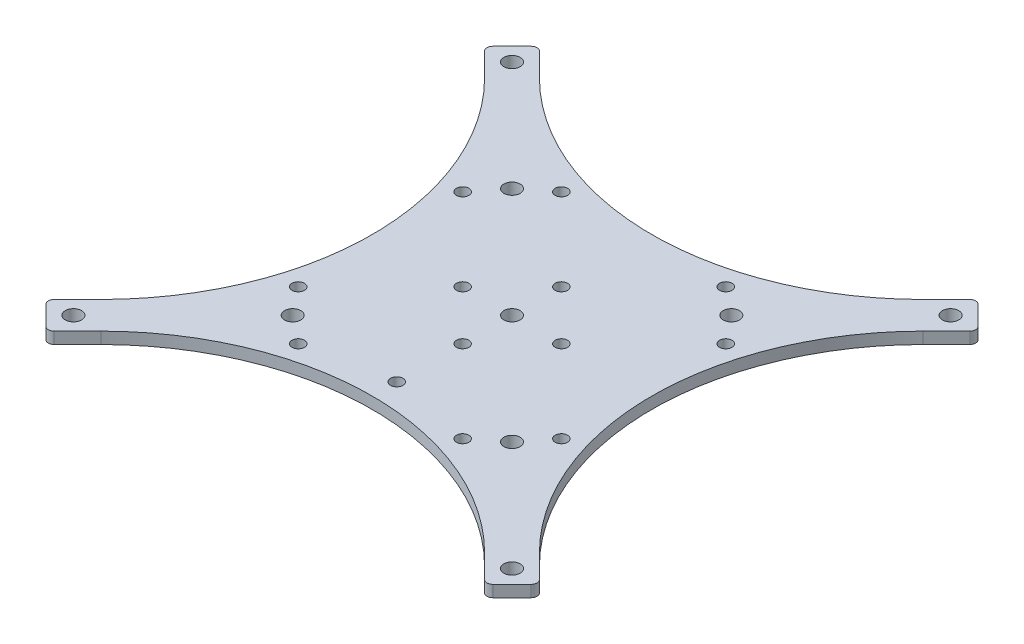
ISO-10303-21;
HEADER;
FILE_DESCRIPTION(('STEP AP214'),'2;1');
FILE_NAME('part.step','',(''),(''),'','','');
FILE_SCHEMA(('AUTOMOTIVE_DESIGN { 1 0 10303 214 1 1 1 1 }'));
ENDSEC;
DATA;
#1=APPLICATION_CONTEXT('core data for automotive mechanical design processes');
#2=APPLICATION_PROTOCOL_DEFINITION('international standard','automotive_design',2000,#1);
#3=PRODUCT_CONTEXT('',#1,'mechanical');
#4=PRODUCT('Part','Part','',(#3));
#5=PRODUCT_RELATED_PRODUCT_CATEGORY('part','',(#4));
#6=PRODUCT_DEFINITION_FORMATION('','',#4);
#7=PRODUCT_DEFINITION_CONTEXT('part definition',#1,'design');
#8=PRODUCT_DEFINITION('design','',#6,#7);
#9=PRODUCT_DEFINITION_SHAPE('','',#8);
#10=(LENGTH_UNIT() NAMED_UNIT(*) SI_UNIT(.MILLI.,.METRE.));
#11=(NAMED_UNIT(*) PLANE_ANGLE_UNIT() SI_UNIT($,.RADIAN.));
#12=(NAMED_UNIT(*) SI_UNIT($,.STERADIAN.) SOLID_ANGLE_UNIT());
#13=UNCERTAINTY_MEASURE_WITH_UNIT(LENGTH_MEASURE(1.E-05),#10,'distance_accuracy_value','');
#14=(GEOMETRIC_REPRESENTATION_CONTEXT(3) GLOBAL_UNCERTAINTY_ASSIGNED_CONTEXT((#13)) GLOBAL_UNIT_ASSIGNED_CONTEXT((#10,
#11,#12)) REPRESENTATION_CONTEXT('',''));
#15=CARTESIAN_POINT('',(0.,0.,0.));
#16=DIRECTION('',(0.,0.,1.));
#17=DIRECTION('',(1.,0.,0.));
#18=AXIS2_PLACEMENT_3D('',#15,#16,#17);
#19=CARTESIAN_POINT('',(-106.066017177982,3.,0.));
#20=DIRECTION('',(0.,-1.,0.));
#21=DIRECTION('',(0.,0.,-1.));
#22=AXIS2_PLACEMENT_3D('',#19,#20,#21);
#23=PLANE('',#22);
#24=DIRECTION('',(-0.707106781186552,0.,0.707106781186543));
#25=VECTOR('',#24,1.);
#26=CARTESIAN_POINT('',(-63.6396103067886,3.,-56.5685424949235));
#27=LINE('',#26,#25);
#28=CARTESIAN_POINT('',(-57.6292026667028,3.,-62.5789501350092));
#29=VERTEX_POINT('',#28);
#30=CARTESIAN_POINT('',(-62.5789501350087,3.,-57.6292026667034));
#31=VERTEX_POINT('',#30);
#32=EDGE_CURVE('E254',#29,#31,#27,.T.);
#33=ORIENTED_EDGE('',*,*,#32,.T.);
#34=CARTESIAN_POINT('',(-61.5182899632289,3.,-56.5685424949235));
#35=DIRECTION('',(0.,-1.,0.));
#36=DIRECTION('',(0.,0.,-1.));
#37=AXIS2_PLACEMENT_3D('',#34,#35,#36);
#38=CIRCLE('',#37,1.5);
#39=CARTESIAN_POINT('',(-62.5789501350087,3.,-55.5078823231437));
#40=VERTEX_POINT('',#39);
#41=EDGE_CURVE('E354',#31,#40,#38,.F.);
#42=ORIENTED_EDGE('',*,*,#41,.T.);
#43=DIRECTION('',(0.707106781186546,0.,0.707106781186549));
#44=VECTOR('',#43,1.);
#45=CARTESIAN_POINT('',(-56.5685424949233,3.,-49.4974746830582));
#46=LINE('',#45,#44);
#47=CARTESIAN_POINT('',(-56.5685424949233,3.,-49.4974746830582));
#48=VERTEX_POINT('',#47);
#49=EDGE_CURVE('E256',#40,#48,#46,.T.);
#50=ORIENTED_EDGE('',*,*,#49,.T.);
#51=CARTESIAN_POINT('',(-106.066017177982,3.,0.));
#52=DIRECTION('',(0.,-1.,0.));
#53=DIRECTION('',(0.,0.,-1.));
#54=AXIS2_PLACEMENT_3D('',#51,#52,#53);
#55=CIRCLE('',#54,70.0000000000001);
#56=CARTESIAN_POINT('',(-56.5685510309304,3.,49.497483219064));
#57=VERTEX_POINT('',#56);
#58=EDGE_CURVE('E258',#48,#57,#55,.T.);
#59=ORIENTED_EDGE('',*,*,#58,.T.);
#60=DIRECTION('',(-0.707106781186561,0.,0.707106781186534));
#61=VECTOR('',#60,1.);
#62=CARTESIAN_POINT('',(-63.6396103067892,3.,56.5685424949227));
#63=LINE('',#62,#61);
#64=CARTESIAN_POINT('',(-62.5789501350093,3.,55.5078823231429));
#65=VERTEX_POINT('',#64);
#66=EDGE_CURVE('E300',#57,#65,#63,.T.);
#67=ORIENTED_EDGE('',*,*,#66,.T.);
#68=CARTESIAN_POINT('',(-61.5182899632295,3.,56.5685424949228));
#69=DIRECTION('',(0.,-1.,0.));
#70=DIRECTION('',(0.,0.,-1.));
#71=AXIS2_PLACEMENT_3D('',#68,#69,#70);
#72=CIRCLE('',#71,1.5);
#73=CARTESIAN_POINT('',(-62.5789501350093,3.,57.6292026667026));
#74=VERTEX_POINT('',#73);
#75=EDGE_CURVE('E343',#65,#74,#72,.F.);
#76=ORIENTED_EDGE('',*,*,#75,.T.);
#77=DIRECTION('',(0.707106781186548,0.,0.707106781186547));
#78=VECTOR('',#77,1.);
#79=CARTESIAN_POINT('',(-56.5685424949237,3.,63.6396103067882));
#80=LINE('',#79,#78);
#81=CARTESIAN_POINT('',(-57.6292026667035,3.,62.5789501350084));
#82=VERTEX_POINT('',#81);
#83=EDGE_CURVE('E216',#74,#82,#80,.T.);
#84=ORIENTED_EDGE('',*,*,#83,.T.);
#85=CARTESIAN_POINT('',(-56.5685424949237,3.,61.5182899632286));
#86=DIRECTION('',(0.,-1.,0.));
#87=DIRECTION('',(0.,0.,-1.));
#88=AXIS2_PLACEMENT_3D('',#85,#86,#87);
#89=CIRCLE('',#88,1.5);
#90=CARTESIAN_POINT('',(-55.5078823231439,3.,62.5789501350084));
#91=VERTEX_POINT('',#90);
#92=EDGE_CURVE('E213',#82,#91,#89,.F.);
#93=ORIENTED_EDGE('',*,*,#92,.T.);
#94=DIRECTION('',(0.707106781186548,0.,-0.707106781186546));
#95=VECTOR('',#94,1.);
#96=CARTESIAN_POINT('',(-49.4974746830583,3.,56.5685424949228));
#97=LINE('',#96,#95);
#98=CARTESIAN_POINT('',(-49.4974746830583,3.,56.5685424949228));
#99=VERTEX_POINT('',#98);
#100=EDGE_CURVE('E203',#91,#99,#97,.T.);
#101=ORIENTED_EDGE('',*,*,#100,.T.);
#102=CARTESIAN_POINT('',(0.,3.,106.066017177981));
#103=DIRECTION('',(0.,-1.,0.));
#104=DIRECTION('',(0.,0.,-1.));
#105=AXIS2_PLACEMENT_3D('',#102,#103,#104);
#106=CIRCLE('',#105,69.9999999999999);
#107=CARTESIAN_POINT('',(49.4974832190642,3.,56.5685510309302));
#108=VERTEX_POINT('',#107);
#109=EDGE_CURVE('E209',#99,#108,#106,.T.);
#110=ORIENTED_EDGE('',*,*,#109,.T.);
#111=DIRECTION('',(0.707106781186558,0.,0.707106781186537));
#112=VECTOR('',#111,1.);
#113=CARTESIAN_POINT('',(56.568542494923,3.,63.639610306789));
#114=LINE('',#113,#112);
#115=CARTESIAN_POINT('',(55.5078823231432,3.,62.5789501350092));
#116=VERTEX_POINT('',#115);
#117=EDGE_CURVE('E231',#108,#116,#114,.T.);
#118=ORIENTED_EDGE('',*,*,#117,.T.);
#119=CARTESIAN_POINT('',(56.568542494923,3.,61.5182899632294));
#120=DIRECTION('',(0.,-1.,0.));
#121=DIRECTION('',(0.,0.,-1.));
#122=AXIS2_PLACEMENT_3D('',#119,#120,#121);
#123=CIRCLE('',#122,1.5);
#124=CARTESIAN_POINT('',(57.6292026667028,3.,62.5789501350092));
#125=VERTEX_POINT('',#124);
#126=EDGE_CURVE('E345',#116,#125,#123,.F.);
#127=ORIENTED_EDGE('',*,*,#126,.T.);
#128=DIRECTION('',(0.707106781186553,0.,-0.707106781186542));
#129=VECTOR('',#128,1.);
#130=CARTESIAN_POINT('',(63.6396103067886,3.,56.5685424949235));
#131=LINE('',#130,#129);
#132=CARTESIAN_POINT('',(62.5789501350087,3.,57.6292026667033));
#133=VERTEX_POINT('',#132);
#134=EDGE_CURVE('E233',#125,#133,#131,.T.);
#135=ORIENTED_EDGE('',*,*,#134,.T.);
#136=CARTESIAN_POINT('',(61.5182899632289,3.,56.5685424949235));
#137=DIRECTION('',(0.,-1.,0.));
#138=DIRECTION('',(0.,0.,-1.));
#139=AXIS2_PLACEMENT_3D('',#136,#137,#138);
#140=CIRCLE('',#139,1.5);
#141=CARTESIAN_POINT('',(62.5789501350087,3.,55.5078823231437));
#142=VERTEX_POINT('',#141);
#143=EDGE_CURVE('E347',#133,#142,#140,.F.);
#144=ORIENTED_EDGE('',*,*,#143,.T.);
#145=DIRECTION('',(-0.707106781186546,0.,-0.707106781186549));
#146=VECTOR('',#145,1.);
#147=CARTESIAN_POINT('',(56.5685424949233,3.,49.4974746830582));
#148=LINE('',#147,#146);
#149=CARTESIAN_POINT('',(56.5685424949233,3.,49.4974746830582));
#150=VERTEX_POINT('',#149);
#151=EDGE_CURVE('E239',#142,#150,#148,.T.);
#152=ORIENTED_EDGE('',*,*,#151,.T.);
#153=CARTESIAN_POINT('',(106.066017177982,3.,0.));
#154=DIRECTION('',(0.,-1.,0.));
#155=DIRECTION('',(0.,0.,-1.));
#156=AXIS2_PLACEMENT_3D('',#153,#154,#155);
#157=CIRCLE('',#156,70.0000000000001);
#158=CARTESIAN_POINT('',(56.5685510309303,3.,-49.497483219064));
#159=VERTEX_POINT('',#158);
#160=EDGE_CURVE('E241',#150,#159,#157,.T.);
#161=ORIENTED_EDGE('',*,*,#160,.T.);
#162=DIRECTION('',(0.707106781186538,0.,-0.707106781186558));
#163=VECTOR('',#162,1.);
#164=CARTESIAN_POINT('',(63.639610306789,3.,-56.568542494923));
#165=LINE('',#164,#163);
#166=CARTESIAN_POINT('',(62.5789501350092,3.,-55.5078823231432));
#167=VERTEX_POINT('',#166);
#168=EDGE_CURVE('E243',#159,#167,#165,.T.);
#169=ORIENTED_EDGE('',*,*,#168,.T.);
#170=CARTESIAN_POINT('',(61.5182899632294,3.,-56.568542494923));
#171=DIRECTION('',(0.,-1.,0.));
#172=DIRECTION('',(0.,0.,-1.));
#173=AXIS2_PLACEMENT_3D('',#170,#171,#172);
#174=CIRCLE('',#173,1.5);
#175=CARTESIAN_POINT('',(62.5789501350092,3.,-57.6292026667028));
#176=VERTEX_POINT('',#175);
#177=EDGE_CURVE('E349',#167,#176,#174,.F.);
#178=ORIENTED_EDGE('',*,*,#177,.T.);
#179=DIRECTION('',(-0.707106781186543,0.,-0.707106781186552));
#180=VECTOR('',#179,1.);
#181=CARTESIAN_POINT('',(56.5685424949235,3.,-63.6396103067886));
#182=LINE('',#181,#180);
#183=CARTESIAN_POINT('',(57.6292026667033,3.,-62.5789501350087));
#184=VERTEX_POINT('',#183);
#185=EDGE_CURVE('E246',#176,#184,#182,.T.);
#186=ORIENTED_EDGE('',*,*,#185,.T.);
#187=CARTESIAN_POINT('',(56.5685424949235,3.,-61.5182899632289));
#188=DIRECTION('',(0.,-1.,0.));
#189=DIRECTION('',(0.,0.,-1.));
#190=AXIS2_PLACEMENT_3D('',#187,#188,#189);
#191=CIRCLE('',#190,1.5);
#192=CARTESIAN_POINT('',(55.5078823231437,3.,-62.5789501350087));
#193=VERTEX_POINT('',#192);
#194=EDGE_CURVE('E64',#184,#193,#191,.F.);
#195=ORIENTED_EDGE('',*,*,#194,.T.);
#196=DIRECTION('',(-0.707106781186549,0.,0.707106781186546));
#197=VECTOR('',#196,1.);
#198=CARTESIAN_POINT('',(49.4974746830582,3.,-56.5685424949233));
#199=LINE('',#198,#197);
#200=CARTESIAN_POINT('',(49.4974746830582,3.,-56.5685424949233));
#201=VERTEX_POINT('',#200);
#202=EDGE_CURVE('E248',#193,#201,#199,.T.);
#203=ORIENTED_EDGE('',*,*,#202,.T.);
#204=CARTESIAN_POINT('',(0.,3.,-106.066017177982));
#205=DIRECTION('',(0.,-1.,0.));
#206=DIRECTION('',(0.,0.,-1.));
#207=AXIS2_PLACEMENT_3D('',#204,#205,#206);
#208=CIRCLE('',#207,70.0000000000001);
#209=CARTESIAN_POINT('',(-49.497483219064,3.,-56.5685510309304));
#210=VERTEX_POINT('',#209);
#211=EDGE_CURVE('E250',#201,#210,#208,.T.);
#212=ORIENTED_EDGE('',*,*,#211,.T.);
#213=DIRECTION('',(-0.707106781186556,0.,-0.707106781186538));
#214=VECTOR('',#213,1.);
#215=CARTESIAN_POINT('',(-56.568542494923,3.,-63.639610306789));
#216=LINE('',#215,#214);
#217=CARTESIAN_POINT('',(-55.5078823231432,3.,-62.5789501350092));
#218=VERTEX_POINT('',#217);
#219=EDGE_CURVE('E252',#210,#218,#216,.T.);
#220=ORIENTED_EDGE('',*,*,#219,.T.);
#221=CARTESIAN_POINT('',(-56.568542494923,3.,-61.5182899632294));
#222=DIRECTION('',(0.,-1.,0.));
#223=DIRECTION('',(0.,0.,-1.));
#224=AXIS2_PLACEMENT_3D('',#221,#222,#223);
#225=CIRCLE('',#224,1.5);
#226=EDGE_CURVE('E352',#218,#29,#225,.F.);
#227=ORIENTED_EDGE('',*,*,#226,.T.);
#228=EDGE_LOOP('',(#33,#42,#50,#59,#67,#76,#84,#93,#101,#110,#118,#127,#135,#144,#152,#161,#169,
#178,#186,#195,#203,#212,#220,#227));
#229=FACE_BOUND('',#228,.T.);
#230=CARTESIAN_POINT('',(-3.33066907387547E-13,3.,-5.82867087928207E-13));
#231=DIRECTION('',(0.,1.,0.));
#232=DIRECTION('',(0.,0.,1.));
#233=AXIS2_PLACEMENT_3D('',#230,#231,#232);
#234=CIRCLE('',#233,2.1);
#235=CARTESIAN_POINT('',(-3.33066907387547E-13,3.,2.09999999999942));
#236=VERTEX_POINT('',#235);
#237=EDGE_CURVE('E265',#236,#236,#234,.T.);
#238=ORIENTED_EDGE('',*,*,#237,.F.);
#239=EDGE_LOOP('',(#238));
#240=FACE_BOUND('',#239,.T.);
#241=CARTESIAN_POINT('',(28.2842712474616,3.,28.2842712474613));
#242=DIRECTION('',(0.,1.,0.));
#243=DIRECTION('',(0.,0.,1.));
#244=AXIS2_PLACEMENT_3D('',#241,#242,#243);
#245=CIRCLE('',#244,2.1);
#246=CARTESIAN_POINT('',(28.2842712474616,3.,30.3842712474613));
#247=VERTEX_POINT('',#246);
#248=EDGE_CURVE('E408',#247,#247,#245,.T.);
#249=ORIENTED_EDGE('',*,*,#248,.F.);
#250=EDGE_LOOP('',(#249));
#251=FACE_BOUND('',#250,.T.);
#252=CARTESIAN_POINT('',(56.5685424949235,3.,56.5685424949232));
#253=DIRECTION('',(0.,1.,0.));
#254=DIRECTION('',(0.,0.,1.));
#255=AXIS2_PLACEMENT_3D('',#252,#253,#254);
#256=CIRCLE('',#255,2.1);
#257=CARTESIAN_POINT('',(56.5685424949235,3.,58.6685424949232));
#258=VERTEX_POINT('',#257);
#259=EDGE_CURVE('E414',#258,#258,#256,.T.);
#260=ORIENTED_EDGE('',*,*,#259,.F.);
#261=EDGE_LOOP('',(#260));
#262=FACE_BOUND('',#261,.T.);
#263=CARTESIAN_POINT('',(-28.2842712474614,3.,28.2842712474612));
#264=DIRECTION('',(0.,1.,0.));
#265=DIRECTION('',(0.,0.,1.));
#266=AXIS2_PLACEMENT_3D('',#263,#264,#265);
#267=CIRCLE('',#266,2.1);
#268=CARTESIAN_POINT('',(-28.2842712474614,3.,30.3842712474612));
#269=VERTEX_POINT('',#268);
#270=EDGE_CURVE('E420',#269,#269,#267,.T.);
#271=ORIENTED_EDGE('',*,*,#270,.F.);
#272=EDGE_LOOP('',(#271));
#273=FACE_BOUND('',#272,.T.);
#274=CARTESIAN_POINT('',(-56.5685424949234,3.,56.568542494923));
#275=DIRECTION('',(0.,1.,0.));
#276=DIRECTION('',(0.,0.,1.));
#277=AXIS2_PLACEMENT_3D('',#274,#275,#276);
#278=CIRCLE('',#277,2.1);
#279=CARTESIAN_POINT('',(-56.5685424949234,3.,58.668542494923));
#280=VERTEX_POINT('',#279);
#281=EDGE_CURVE('E426',#280,#280,#278,.T.);
#282=ORIENTED_EDGE('',*,*,#281,.F.);
#283=EDGE_LOOP('',(#282));
#284=FACE_BOUND('',#283,.T.);
#285=CARTESIAN_POINT('',(-28.2842712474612,3.,-28.2842712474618));
#286=DIRECTION('',(0.,1.,0.));
#287=DIRECTION('',(0.,0.,1.));
#288=AXIS2_PLACEMENT_3D('',#285,#286,#287);
#289=CIRCLE('',#288,2.1);
#290=CARTESIAN_POINT('',(-28.2842712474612,3.,-26.1842712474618));
#291=VERTEX_POINT('',#290);
#292=EDGE_CURVE('E432',#291,#291,#289,.T.);
#293=ORIENTED_EDGE('',*,*,#292,.F.);
#294=EDGE_LOOP('',(#293));
#295=FACE_BOUND('',#294,.T.);
#296=CARTESIAN_POINT('',(-56.5685424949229,3.,-56.5685424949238));
#297=DIRECTION('',(0.,1.,0.));
#298=DIRECTION('',(0.,0.,1.));
#299=AXIS2_PLACEMENT_3D('',#296,#297,#298);
#300=CIRCLE('',#299,2.1);
#301=CARTESIAN_POINT('',(-56.5685424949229,3.,-54.4685424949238));
#302=VERTEX_POINT('',#301);
#303=EDGE_CURVE('E438',#302,#302,#300,.T.);
#304=ORIENTED_EDGE('',*,*,#303,.F.);
#305=EDGE_LOOP('',(#304));
#306=FACE_BOUND('',#305,.T.);
#307=CARTESIAN_POINT('',(28.2842712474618,3.,-28.2842712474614));
#308=DIRECTION('',(0.,1.,0.));
#309=DIRECTION('',(0.,0.,1.));
#310=AXIS2_PLACEMENT_3D('',#307,#308,#309);
#311=CIRCLE('',#310,2.1);
#312=CARTESIAN_POINT('',(28.2842712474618,3.,-26.1842712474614));
#313=VERTEX_POINT('',#312);
#314=EDGE_CURVE('E444',#313,#313,#311,.T.);
#315=ORIENTED_EDGE('',*,*,#314,.F.);
#316=EDGE_LOOP('',(#315));
#317=FACE_BOUND('',#316,.T.);
#318=CARTESIAN_POINT('',(56.5685424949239,3.,-56.568542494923));
#319=DIRECTION('',(0.,1.,0.));
#320=DIRECTION('',(0.,0.,1.));
#321=AXIS2_PLACEMENT_3D('',#318,#319,#320);
#322=CIRCLE('',#321,2.1);
#323=CARTESIAN_POINT('',(56.5685424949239,3.,-54.468542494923));
#324=VERTEX_POINT('',#323);
#325=EDGE_CURVE('E450',#324,#324,#322,.T.);
#326=ORIENTED_EDGE('',*,*,#325,.F.);
#327=EDGE_LOOP('',(#326));
#328=FACE_BOUND('',#327,.T.);
#329=CARTESIAN_POINT('',(21.2132034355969,3.,33.9411254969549));
#330=DIRECTION('',(0.,1.,0.));
#331=DIRECTION('',(0.,0.,1.));
#332=AXIS2_PLACEMENT_3D('',#329,#330,#331);
#333=CIRCLE('',#332,1.6);
#334=CARTESIAN_POINT('',(21.2132034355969,3.,35.5411254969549));
#335=VERTEX_POINT('',#334);
#336=EDGE_CURVE('E456',#335,#335,#333,.T.);
#337=ORIENTED_EDGE('',*,*,#336,.F.);
#338=EDGE_LOOP('',(#337));
#339=FACE_BOUND('',#338,.T.);
#340=CARTESIAN_POINT('',(0.,3.,12.7279220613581));
#341=DIRECTION('',(0.,1.,0.));
#342=DIRECTION('',(0.,0.,1.));
#343=AXIS2_PLACEMENT_3D('',#340,#341,#342);
#344=CIRCLE('',#343,1.6);
#345=CARTESIAN_POINT('',(0.,3.,14.3279220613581));
#346=VERTEX_POINT('',#345);
#347=EDGE_CURVE('E462',#346,#346,#344,.T.);
#348=ORIENTED_EDGE('',*,*,#347,.F.);
#349=EDGE_LOOP('',(#348));
#350=FACE_BOUND('',#349,.T.);
#351=CARTESIAN_POINT('',(0.,3.,29.7279220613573));
#352=DIRECTION('',(0.,1.,0.));
#353=DIRECTION('',(0.,0.,1.));
#354=AXIS2_PLACEMENT_3D('',#351,#352,#353);
#355=CIRCLE('',#354,1.6);
#356=CARTESIAN_POINT('',(0.,3.,31.3279220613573));
#357=VERTEX_POINT('',#356);
#358=EDGE_CURVE('E468',#357,#357,#355,.T.);
#359=ORIENTED_EDGE('',*,*,#358,.F.);
#360=EDGE_LOOP('',(#359));
#361=FACE_BOUND('',#360,.T.);
#362=CARTESIAN_POINT('',(-21.2132034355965,3.,33.9411254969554));
#363=DIRECTION('',(0.,1.,0.));
#364=DIRECTION('',(0.,0.,1.));
#365=AXIS2_PLACEMENT_3D('',#362,#363,#364);
#366=CIRCLE('',#365,1.6);
#367=CARTESIAN_POINT('',(-21.2132034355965,3.,35.5411254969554));
#368=VERTEX_POINT('',#367);
#369=EDGE_CURVE('E474',#368,#368,#366,.T.);
#370=ORIENTED_EDGE('',*,*,#369,.F.);
#371=EDGE_LOOP('',(#370));
#372=FACE_BOUND('',#371,.T.);
#373=CARTESIAN_POINT('',(-33.941125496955,3.,21.213203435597));
#374=DIRECTION('',(0.,1.,0.));
#375=DIRECTION('',(0.,0.,1.));
#376=AXIS2_PLACEMENT_3D('',#373,#374,#375);
#377=CIRCLE('',#376,1.6);
#378=CARTESIAN_POINT('',(-33.941125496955,3.,22.813203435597));
#379=VERTEX_POINT('',#378);
#380=EDGE_CURVE('E480',#379,#379,#377,.T.);
#381=ORIENTED_EDGE('',*,*,#380,.F.);
#382=EDGE_LOOP('',(#381));
#383=FACE_BOUND('',#382,.T.);
#384=CARTESIAN_POINT('',(-12.7279220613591,3.,0.));
#385=DIRECTION('',(0.,1.,0.));
#386=DIRECTION('',(0.,0.,1.));
#387=AXIS2_PLACEMENT_3D('',#384,#385,#386);
#388=CIRCLE('',#387,1.6);
#389=CARTESIAN_POINT('',(-12.7279220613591,3.,1.6));
#390=VERTEX_POINT('',#389);
#391=EDGE_CURVE('E486',#390,#390,#388,.T.);
#392=ORIENTED_EDGE('',*,*,#391,.F.);
#393=EDGE_LOOP('',(#392));
#394=FACE_BOUND('',#393,.T.);
#395=CARTESIAN_POINT('',(-33.9411254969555,3.,-21.2132034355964));
#396=DIRECTION('',(0.,1.,0.));
#397=DIRECTION('',(0.,0.,1.));
#398=AXIS2_PLACEMENT_3D('',#395,#396,#397);
#399=CIRCLE('',#398,1.6);
#400=CARTESIAN_POINT('',(-33.9411254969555,3.,-19.6132034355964));
#401=VERTEX_POINT('',#400);
#402=EDGE_CURVE('E492',#401,#401,#399,.T.);
#403=ORIENTED_EDGE('',*,*,#402,.F.);
#404=EDGE_LOOP('',(#403));
#405=FACE_BOUND('',#404,.T.);
#406=CARTESIAN_POINT('',(-21.213203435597,3.,-33.941125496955));
#407=DIRECTION('',(0.,1.,0.));
#408=DIRECTION('',(0.,0.,1.));
#409=AXIS2_PLACEMENT_3D('',#406,#407,#408);
#410=CIRCLE('',#409,1.6);
#411=CARTESIAN_POINT('',(-21.213203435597,3.,-32.341125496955));
#412=VERTEX_POINT('',#411);
#413=EDGE_CURVE('E498',#412,#412,#410,.T.);
#414=ORIENTED_EDGE('',*,*,#413,.F.);
#415=EDGE_LOOP('',(#414));
#416=FACE_BOUND('',#415,.T.);
#417=CARTESIAN_POINT('',(0.,3.,-12.7279220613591));
#418=DIRECTION('',(0.,1.,0.));
#419=DIRECTION('',(0.,0.,1.));
#420=AXIS2_PLACEMENT_3D('',#417,#418,#419);
#421=CIRCLE('',#420,1.6);
#422=CARTESIAN_POINT('',(0.,3.,-11.1279220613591));
#423=VERTEX_POINT('',#422);
#424=EDGE_CURVE('E504',#423,#423,#421,.T.);
#425=ORIENTED_EDGE('',*,*,#424,.F.);
#426=EDGE_LOOP('',(#425));
#427=FACE_BOUND('',#426,.T.);
#428=CARTESIAN_POINT('',(21.2132034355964,3.,-33.9411254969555));
#429=DIRECTION('',(0.,1.,0.));
#430=DIRECTION('',(0.,0.,1.));
#431=AXIS2_PLACEMENT_3D('',#428,#429,#430);
#432=CIRCLE('',#431,1.6);
#433=CARTESIAN_POINT('',(21.2132034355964,3.,-32.3411254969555));
#434=VERTEX_POINT('',#433);
#435=EDGE_CURVE('E510',#434,#434,#432,.T.);
#436=ORIENTED_EDGE('',*,*,#435,.F.);
#437=EDGE_LOOP('',(#436));
#438=FACE_BOUND('',#437,.T.);
#439=CARTESIAN_POINT('',(33.941125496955,3.,-21.213203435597));
#440=DIRECTION('',(0.,1.,0.));
#441=DIRECTION('',(0.,0.,1.));
#442=AXIS2_PLACEMENT_3D('',#439,#440,#441);
#443=CIRCLE('',#442,1.6);
#444=CARTESIAN_POINT('',(33.941125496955,3.,-19.613203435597));
#445=VERTEX_POINT('',#444);
#446=EDGE_CURVE('E516',#445,#445,#443,.T.);
#447=ORIENTED_EDGE('',*,*,#446,.F.);
#448=EDGE_LOOP('',(#447));
#449=FACE_BOUND('',#448,.T.);
#450=CARTESIAN_POINT('',(12.7279220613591,3.,0.));
#451=DIRECTION('',(0.,1.,0.));
#452=DIRECTION('',(0.,0.,1.));
#453=AXIS2_PLACEMENT_3D('',#450,#451,#452);
#454=CIRCLE('',#453,1.6);
#455=CARTESIAN_POINT('',(12.7279220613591,3.,1.6));
#456=VERTEX_POINT('',#455);
#457=EDGE_CURVE('E522',#456,#456,#454,.T.);
#458=ORIENTED_EDGE('',*,*,#457,.F.);
#459=EDGE_LOOP('',(#458));
#460=FACE_BOUND('',#459,.T.);
#461=CARTESIAN_POINT('',(33.9411254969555,3.,21.2132034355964));
#462=DIRECTION('',(0.,1.,0.));
#463=DIRECTION('',(0.,0.,1.));
#464=AXIS2_PLACEMENT_3D('',#461,#462,#463);
#465=CIRCLE('',#464,1.6);
#466=CARTESIAN_POINT('',(33.9411254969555,3.,22.8132034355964));
#467=VERTEX_POINT('',#466);
#468=EDGE_CURVE('E528',#467,#467,#465,.T.);
#469=ORIENTED_EDGE('',*,*,#468,.F.);
#470=EDGE_LOOP('',(#469));
#471=FACE_BOUND('',#470,.T.);
#472=ADVANCED_FACE('F41',(#229,#240,#251,#262,#273,#284,#295,#306,#317,#328,#339,#350,#361,#372,
#383,#394,#405,#416,#427,#438,#449,#460,#471),#23,.F.);
#473=CARTESIAN_POINT('',(-106.066017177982,0.,0.));
#474=DIRECTION('',(0.,-1.,0.));
#475=DIRECTION('',(0.,0.,-1.));
#476=AXIS2_PLACEMENT_3D('',#473,#474,#475);
#477=PLANE('',#476);
#478=CARTESIAN_POINT('',(12.7279220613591,0.,0.));
#479=DIRECTION('',(0.,1.,0.));
#480=DIRECTION('',(0.,0.,1.));
#481=AXIS2_PLACEMENT_3D('',#478,#479,#480);
#482=CIRCLE('',#481,1.6);
#483=CARTESIAN_POINT('',(12.7279220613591,0.,1.6));
#484=VERTEX_POINT('',#483);
#485=EDGE_CURVE('E525',#484,#484,#482,.T.);
#486=ORIENTED_EDGE('',*,*,#485,.T.);
#487=EDGE_LOOP('',(#486));
#488=FACE_BOUND('',#487,.T.);
#489=CARTESIAN_POINT('',(21.2132034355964,0.,-33.9411254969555));
#490=DIRECTION('',(0.,1.,0.));
#491=DIRECTION('',(0.,0.,1.));
#492=AXIS2_PLACEMENT_3D('',#489,#490,#491);
#493=CIRCLE('',#492,1.6);
#494=CARTESIAN_POINT('',(21.2132034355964,0.,-32.3411254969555));
#495=VERTEX_POINT('',#494);
#496=EDGE_CURVE('E513',#495,#495,#493,.T.);
#497=ORIENTED_EDGE('',*,*,#496,.T.);
#498=EDGE_LOOP('',(#497));
#499=FACE_BOUND('',#498,.T.);
#500=CARTESIAN_POINT('',(-21.213203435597,0.,-33.941125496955));
#501=DIRECTION('',(0.,1.,0.));
#502=DIRECTION('',(0.,0.,1.));
#503=AXIS2_PLACEMENT_3D('',#500,#501,#502);
#504=CIRCLE('',#503,1.6);
#505=CARTESIAN_POINT('',(-21.213203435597,0.,-32.341125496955));
#506=VERTEX_POINT('',#505);
#507=EDGE_CURVE('E501',#506,#506,#504,.T.);
#508=ORIENTED_EDGE('',*,*,#507,.T.);
#509=EDGE_LOOP('',(#508));
#510=FACE_BOUND('',#509,.T.);
#511=CARTESIAN_POINT('',(-12.7279220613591,0.,0.));
#512=DIRECTION('',(0.,1.,0.));
#513=DIRECTION('',(0.,0.,1.));
#514=AXIS2_PLACEMENT_3D('',#511,#512,#513);
#515=CIRCLE('',#514,1.6);
#516=CARTESIAN_POINT('',(-12.7279220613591,0.,1.6));
#517=VERTEX_POINT('',#516);
#518=EDGE_CURVE('E489',#517,#517,#515,.T.);
#519=ORIENTED_EDGE('',*,*,#518,.T.);
#520=EDGE_LOOP('',(#519));
#521=FACE_BOUND('',#520,.T.);
#522=CARTESIAN_POINT('',(-21.2132034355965,0.,33.9411254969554));
#523=DIRECTION('',(0.,1.,0.));
#524=DIRECTION('',(0.,0.,1.));
#525=AXIS2_PLACEMENT_3D('',#522,#523,#524);
#526=CIRCLE('',#525,1.6);
#527=CARTESIAN_POINT('',(-21.2132034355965,0.,35.5411254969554));
#528=VERTEX_POINT('',#527);
#529=EDGE_CURVE('E477',#528,#528,#526,.T.);
#530=ORIENTED_EDGE('',*,*,#529,.T.);
#531=EDGE_LOOP('',(#530));
#532=FACE_BOUND('',#531,.T.);
#533=CARTESIAN_POINT('',(0.,0.,12.7279220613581));
#534=DIRECTION('',(0.,1.,0.));
#535=DIRECTION('',(0.,0.,1.));
#536=AXIS2_PLACEMENT_3D('',#533,#534,#535);
#537=CIRCLE('',#536,1.6);
#538=CARTESIAN_POINT('',(0.,0.,14.3279220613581));
#539=VERTEX_POINT('',#538);
#540=EDGE_CURVE('E465',#539,#539,#537,.T.);
#541=ORIENTED_EDGE('',*,*,#540,.T.);
#542=EDGE_LOOP('',(#541));
#543=FACE_BOUND('',#542,.T.);
#544=CARTESIAN_POINT('',(56.5685424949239,0.,-56.568542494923));
#545=DIRECTION('',(0.,1.,0.));
#546=DIRECTION('',(0.,0.,1.));
#547=AXIS2_PLACEMENT_3D('',#544,#545,#546);
#548=CIRCLE('',#547,2.1);
#549=CARTESIAN_POINT('',(56.5685424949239,0.,-54.468542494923));
#550=VERTEX_POINT('',#549);
#551=EDGE_CURVE('E453',#550,#550,#548,.T.);
#552=ORIENTED_EDGE('',*,*,#551,.T.);
#553=EDGE_LOOP('',(#552));
#554=FACE_BOUND('',#553,.T.);
#555=CARTESIAN_POINT('',(-56.5685424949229,0.,-56.5685424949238));
#556=DIRECTION('',(0.,1.,0.));
#557=DIRECTION('',(0.,0.,1.));
#558=AXIS2_PLACEMENT_3D('',#555,#556,#557);
#559=CIRCLE('',#558,2.1);
#560=CARTESIAN_POINT('',(-56.5685424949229,0.,-54.4685424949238));
#561=VERTEX_POINT('',#560);
#562=EDGE_CURVE('E441',#561,#561,#559,.T.);
#563=ORIENTED_EDGE('',*,*,#562,.T.);
#564=EDGE_LOOP('',(#563));
#565=FACE_BOUND('',#564,.T.);
#566=CARTESIAN_POINT('',(-56.5685424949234,0.,56.568542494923));
#567=DIRECTION('',(0.,1.,0.));
#568=DIRECTION('',(0.,0.,1.));
#569=AXIS2_PLACEMENT_3D('',#566,#567,#568);
#570=CIRCLE('',#569,2.1);
#571=CARTESIAN_POINT('',(-56.5685424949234,0.,58.668542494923));
#572=VERTEX_POINT('',#571);
#573=EDGE_CURVE('E429',#572,#572,#570,.T.);
#574=ORIENTED_EDGE('',*,*,#573,.T.);
#575=EDGE_LOOP('',(#574));
#576=FACE_BOUND('',#575,.T.);
#577=CARTESIAN_POINT('',(56.5685424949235,0.,56.5685424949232));
#578=DIRECTION('',(0.,1.,0.));
#579=DIRECTION('',(0.,0.,1.));
#580=AXIS2_PLACEMENT_3D('',#577,#578,#579);
#581=CIRCLE('',#580,2.1);
#582=CARTESIAN_POINT('',(56.5685424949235,0.,58.6685424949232));
#583=VERTEX_POINT('',#582);
#584=EDGE_CURVE('E417',#583,#583,#581,.T.);
#585=ORIENTED_EDGE('',*,*,#584,.T.);
#586=EDGE_LOOP('',(#585));
#587=FACE_BOUND('',#586,.T.);
#588=CARTESIAN_POINT('',(-3.33066907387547E-13,0.,-5.82867087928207E-13));
#589=DIRECTION('',(0.,1.,0.));
#590=DIRECTION('',(0.,0.,1.));
#591=AXIS2_PLACEMENT_3D('',#588,#589,#590);
#592=CIRCLE('',#591,2.1);
#593=CARTESIAN_POINT('',(-3.33066907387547E-13,0.,2.09999999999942));
#594=VERTEX_POINT('',#593);
#595=EDGE_CURVE('E405',#594,#594,#592,.T.);
#596=ORIENTED_EDGE('',*,*,#595,.T.);
#597=EDGE_LOOP('',(#596));
#598=FACE_BOUND('',#597,.T.);
#599=DIRECTION('',(0.707106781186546,0.,0.707106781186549));
#600=VECTOR('',#599,1.);
#601=CARTESIAN_POINT('',(-56.5685424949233,0.,-49.4974746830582));
#602=LINE('',#601,#600);
#603=CARTESIAN_POINT('',(-62.5789501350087,0.,-55.5078823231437));
#604=VERTEX_POINT('',#603);
#605=CARTESIAN_POINT('',(-56.5685424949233,0.,-49.4974746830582));
#606=VERTEX_POINT('',#605);
#607=EDGE_CURVE('E296',#604,#606,#602,.T.);
#608=ORIENTED_EDGE('',*,*,#607,.F.);
#609=CARTESIAN_POINT('',(-61.5182899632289,0.,-56.5685424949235));
#610=DIRECTION('',(0.,-1.,0.));
#611=DIRECTION('',(0.,0.,-1.));
#612=AXIS2_PLACEMENT_3D('',#609,#610,#611);
#613=CIRCLE('',#612,1.5);
#614=CARTESIAN_POINT('',(-62.5789501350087,0.,-57.6292026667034));
#615=VERTEX_POINT('',#614);
#616=EDGE_CURVE('E335',#604,#615,#613,.T.);
#617=ORIENTED_EDGE('',*,*,#616,.T.);
#618=DIRECTION('',(-0.707106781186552,0.,0.707106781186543));
#619=VECTOR('',#618,1.);
#620=CARTESIAN_POINT('',(-63.6396103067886,0.,-56.5685424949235));
#621=LINE('',#620,#619);
#622=CARTESIAN_POINT('',(-57.6292026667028,0.,-62.5789501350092));
#623=VERTEX_POINT('',#622);
#624=EDGE_CURVE('E293',#623,#615,#621,.T.);
#625=ORIENTED_EDGE('',*,*,#624,.F.);
#626=CARTESIAN_POINT('',(-56.568542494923,0.,-61.5182899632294));
#627=DIRECTION('',(0.,-1.,0.));
#628=DIRECTION('',(0.,0.,-1.));
#629=AXIS2_PLACEMENT_3D('',#626,#627,#628);
#630=CIRCLE('',#629,1.5);
#631=CARTESIAN_POINT('',(-55.5078823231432,0.,-62.5789501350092));
#632=VERTEX_POINT('',#631);
#633=EDGE_CURVE('E333',#623,#632,#630,.T.);
#634=ORIENTED_EDGE('',*,*,#633,.T.);
#635=DIRECTION('',(-0.707106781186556,0.,-0.707106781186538));
#636=VECTOR('',#635,1.);
#637=CARTESIAN_POINT('',(-56.568542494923,0.,-63.639610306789));
#638=LINE('',#637,#636);
#639=CARTESIAN_POINT('',(-49.497483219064,0.,-56.5685510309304));
#640=VERTEX_POINT('',#639);
#641=EDGE_CURVE('E291',#640,#632,#638,.T.);
#642=ORIENTED_EDGE('',*,*,#641,.F.);
#643=CARTESIAN_POINT('',(0.,0.,-106.066017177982));
#644=DIRECTION('',(0.,-1.,0.));
#645=DIRECTION('',(0.,0.,-1.));
#646=AXIS2_PLACEMENT_3D('',#643,#644,#645);
#647=CIRCLE('',#646,70.0000000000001);
#648=CARTESIAN_POINT('',(49.4974746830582,0.,-56.5685424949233));
#649=VERTEX_POINT('',#648);
#650=EDGE_CURVE('E289',#649,#640,#647,.T.);
#651=ORIENTED_EDGE('',*,*,#650,.F.);
#652=DIRECTION('',(-0.707106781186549,0.,0.707106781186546));
#653=VECTOR('',#652,1.);
#654=CARTESIAN_POINT('',(49.4974746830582,0.,-56.5685424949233));
#655=LINE('',#654,#653);
#656=CARTESIAN_POINT('',(55.5078823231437,0.,-62.5789501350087));
#657=VERTEX_POINT('',#656);
#658=EDGE_CURVE('E287',#657,#649,#655,.T.);
#659=ORIENTED_EDGE('',*,*,#658,.F.);
#660=CARTESIAN_POINT('',(56.5685424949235,0.,-61.5182899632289));
#661=DIRECTION('',(0.,-1.,0.));
#662=DIRECTION('',(0.,0.,-1.));
#663=AXIS2_PLACEMENT_3D('',#660,#661,#662);
#664=CIRCLE('',#663,1.5);
#665=CARTESIAN_POINT('',(57.6292026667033,0.,-62.5789501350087));
#666=VERTEX_POINT('',#665);
#667=EDGE_CURVE('E331',#657,#666,#664,.T.);
#668=ORIENTED_EDGE('',*,*,#667,.T.);
#669=DIRECTION('',(-0.707106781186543,0.,-0.707106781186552));
#670=VECTOR('',#669,1.);
#671=CARTESIAN_POINT('',(56.5685424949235,0.,-63.6396103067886));
#672=LINE('',#671,#670);
#673=CARTESIAN_POINT('',(62.5789501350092,0.,-57.6292026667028));
#674=VERTEX_POINT('',#673);
#675=EDGE_CURVE('E284',#674,#666,#672,.T.);
#676=ORIENTED_EDGE('',*,*,#675,.F.);
#677=CARTESIAN_POINT('',(61.5182899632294,0.,-56.568542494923));
#678=DIRECTION('',(0.,-1.,0.));
#679=DIRECTION('',(0.,0.,-1.));
#680=AXIS2_PLACEMENT_3D('',#677,#678,#679);
#681=CIRCLE('',#680,1.5);
#682=CARTESIAN_POINT('',(62.5789501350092,0.,-55.5078823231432));
#683=VERTEX_POINT('',#682);
#684=EDGE_CURVE('E329',#674,#683,#681,.T.);
#685=ORIENTED_EDGE('',*,*,#684,.T.);
#686=DIRECTION('',(0.707106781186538,0.,-0.707106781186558));
#687=VECTOR('',#686,1.);
#688=CARTESIAN_POINT('',(63.639610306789,0.,-56.568542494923));
#689=LINE('',#688,#687);
#690=CARTESIAN_POINT('',(56.5685510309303,0.,-49.497483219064));
#691=VERTEX_POINT('',#690);
#692=EDGE_CURVE('E281',#691,#683,#689,.T.);
#693=ORIENTED_EDGE('',*,*,#692,.F.);
#694=CARTESIAN_POINT('',(106.066017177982,0.,0.));
#695=DIRECTION('',(0.,-1.,0.));
#696=DIRECTION('',(0.,0.,-1.));
#697=AXIS2_PLACEMENT_3D('',#694,#695,#696);
#698=CIRCLE('',#697,70.0000000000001);
#699=CARTESIAN_POINT('',(56.5685424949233,0.,49.4974746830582));
#700=VERTEX_POINT('',#699);
#701=EDGE_CURVE('E279',#700,#691,#698,.T.);
#702=ORIENTED_EDGE('',*,*,#701,.F.);
#703=DIRECTION('',(-0.707106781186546,0.,-0.707106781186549));
#704=VECTOR('',#703,1.);
#705=CARTESIAN_POINT('',(56.5685424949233,0.,49.4974746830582));
#706=LINE('',#705,#704);
#707=CARTESIAN_POINT('',(62.5789501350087,0.,55.5078823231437));
#708=VERTEX_POINT('',#707);
#709=EDGE_CURVE('E277',#708,#700,#706,.T.);
#710=ORIENTED_EDGE('',*,*,#709,.F.);
#711=CARTESIAN_POINT('',(61.5182899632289,0.,56.5685424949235));
#712=DIRECTION('',(0.,-1.,0.));
#713=DIRECTION('',(0.,0.,-1.));
#714=AXIS2_PLACEMENT_3D('',#711,#712,#713);
#715=CIRCLE('',#714,1.5);
#716=CARTESIAN_POINT('',(62.5789501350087,0.,57.6292026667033));
#717=VERTEX_POINT('',#716);
#718=EDGE_CURVE('E327',#708,#717,#715,.T.);
#719=ORIENTED_EDGE('',*,*,#718,.T.);
#720=DIRECTION('',(0.707106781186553,0.,-0.707106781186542));
#721=VECTOR('',#720,1.);
#722=CARTESIAN_POINT('',(63.6396103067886,0.,56.5685424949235));
#723=LINE('',#722,#721);
#724=CARTESIAN_POINT('',(57.6292026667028,0.,62.5789501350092));
#725=VERTEX_POINT('',#724);
#726=EDGE_CURVE('E274',#725,#717,#723,.T.);
#727=ORIENTED_EDGE('',*,*,#726,.F.);
#728=CARTESIAN_POINT('',(56.568542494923,0.,61.5182899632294));
#729=DIRECTION('',(0.,-1.,0.));
#730=DIRECTION('',(0.,0.,-1.));
#731=AXIS2_PLACEMENT_3D('',#728,#729,#730);
#732=CIRCLE('',#731,1.5);
#733=CARTESIAN_POINT('',(55.5078823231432,0.,62.5789501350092));
#734=VERTEX_POINT('',#733);
#735=EDGE_CURVE('E325',#725,#734,#732,.T.);
#736=ORIENTED_EDGE('',*,*,#735,.T.);
#737=DIRECTION('',(0.707106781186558,0.,0.707106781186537));
#738=VECTOR('',#737,1.);
#739=CARTESIAN_POINT('',(56.568542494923,0.,63.639610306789));
#740=LINE('',#739,#738);
#741=CARTESIAN_POINT('',(49.4974832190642,0.,56.5685510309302));
#742=VERTEX_POINT('',#741);
#743=EDGE_CURVE('E271',#742,#734,#740,.T.);
#744=ORIENTED_EDGE('',*,*,#743,.F.);
#745=CARTESIAN_POINT('',(0.,0.,106.066017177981));
#746=DIRECTION('',(0.,-1.,0.));
#747=DIRECTION('',(0.,0.,-1.));
#748=AXIS2_PLACEMENT_3D('',#745,#746,#747);
#749=CIRCLE('',#748,69.9999999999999);
#750=CARTESIAN_POINT('',(-49.4974746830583,0.,56.5685424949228));
#751=VERTEX_POINT('',#750);
#752=EDGE_CURVE('E269',#751,#742,#749,.T.);
#753=ORIENTED_EDGE('',*,*,#752,.F.);
#754=DIRECTION('',(0.707106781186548,0.,-0.707106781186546));
#755=VECTOR('',#754,1.);
#756=CARTESIAN_POINT('',(-49.4974746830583,0.,56.5685424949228));
#757=LINE('',#756,#755);
#758=CARTESIAN_POINT('',(-55.5078823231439,0.,62.5789501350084));
#759=VERTEX_POINT('',#758);
#760=EDGE_CURVE('E222',#759,#751,#757,.T.);
#761=ORIENTED_EDGE('',*,*,#760,.F.);
#762=CARTESIAN_POINT('',(-56.5685424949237,0.,61.5182899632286));
#763=DIRECTION('',(0.,-1.,0.));
#764=DIRECTION('',(0.,0.,-1.));
#765=AXIS2_PLACEMENT_3D('',#762,#763,#764);
#766=CIRCLE('',#765,1.5);
#767=CARTESIAN_POINT('',(-57.6292026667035,0.,62.5789501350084));
#768=VERTEX_POINT('',#767);
#769=EDGE_CURVE('E321',#759,#768,#766,.T.);
#770=ORIENTED_EDGE('',*,*,#769,.T.);
#771=DIRECTION('',(0.707106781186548,0.,0.707106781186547));
#772=VECTOR('',#771,1.);
#773=CARTESIAN_POINT('',(-56.5685424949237,0.,63.6396103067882));
#774=LINE('',#773,#772);
#775=CARTESIAN_POINT('',(-62.5789501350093,0.,57.6292026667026));
#776=VERTEX_POINT('',#775);
#777=EDGE_CURVE('E264',#776,#768,#774,.T.);
#778=ORIENTED_EDGE('',*,*,#777,.F.);
#779=CARTESIAN_POINT('',(-61.5182899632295,0.,56.5685424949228));
#780=DIRECTION('',(0.,-1.,0.));
#781=DIRECTION('',(0.,0.,-1.));
#782=AXIS2_PLACEMENT_3D('',#779,#780,#781);
#783=CIRCLE('',#782,1.5);
#784=CARTESIAN_POINT('',(-62.5789501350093,0.,55.5078823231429));
#785=VERTEX_POINT('',#784);
#786=EDGE_CURVE('E323',#776,#785,#783,.T.);
#787=ORIENTED_EDGE('',*,*,#786,.T.);
#788=DIRECTION('',(-0.707106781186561,0.,0.707106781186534));
#789=VECTOR('',#788,1.);
#790=CARTESIAN_POINT('',(-63.6396103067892,0.,56.5685424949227));
#791=LINE('',#790,#789);
#792=CARTESIAN_POINT('',(-56.5685510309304,0.,49.497483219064));
#793=VERTEX_POINT('',#792);
#794=EDGE_CURVE('E261',#793,#785,#791,.T.);
#795=ORIENTED_EDGE('',*,*,#794,.F.);
#796=CARTESIAN_POINT('',(-106.066017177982,0.,0.));
#797=DIRECTION('',(0.,-1.,0.));
#798=DIRECTION('',(0.,0.,-1.));
#799=AXIS2_PLACEMENT_3D('',#796,#797,#798);
#800=CIRCLE('',#799,70.0000000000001);
#801=EDGE_CURVE('E298',#606,#793,#800,.T.);
#802=ORIENTED_EDGE('',*,*,#801,.F.);
#803=EDGE_LOOP('',(#608,#617,#625,#634,#642,#651,#659,#668,#676,#685,#693,#702,#710,#719,#727,
#736,#744,#753,#761,#770,#778,#787,#795,#802));
#804=FACE_BOUND('',#803,.T.);
#805=CARTESIAN_POINT('',(28.2842712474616,0.,28.2842712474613));
#806=DIRECTION('',(0.,1.,0.));
#807=DIRECTION('',(0.,0.,1.));
#808=AXIS2_PLACEMENT_3D('',#805,#806,#807);
#809=CIRCLE('',#808,2.1);
#810=CARTESIAN_POINT('',(28.2842712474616,0.,30.3842712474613));
#811=VERTEX_POINT('',#810);
#812=EDGE_CURVE('E411',#811,#811,#809,.T.);
#813=ORIENTED_EDGE('',*,*,#812,.T.);
#814=EDGE_LOOP('',(#813));
#815=FACE_BOUND('',#814,.T.);
#816=CARTESIAN_POINT('',(-28.2842712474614,0.,28.2842712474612));
#817=DIRECTION('',(0.,1.,0.));
#818=DIRECTION('',(0.,0.,1.));
#819=AXIS2_PLACEMENT_3D('',#816,#817,#818);
#820=CIRCLE('',#819,2.1);
#821=CARTESIAN_POINT('',(-28.2842712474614,0.,30.3842712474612));
#822=VERTEX_POINT('',#821);
#823=EDGE_CURVE('E423',#822,#822,#820,.T.);
#824=ORIENTED_EDGE('',*,*,#823,.T.);
#825=EDGE_LOOP('',(#824));
#826=FACE_BOUND('',#825,.T.);
#827=CARTESIAN_POINT('',(-28.2842712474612,0.,-28.2842712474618));
#828=DIRECTION('',(0.,1.,0.));
#829=DIRECTION('',(0.,0.,1.));
#830=AXIS2_PLACEMENT_3D('',#827,#828,#829);
#831=CIRCLE('',#830,2.1);
#832=CARTESIAN_POINT('',(-28.2842712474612,0.,-26.1842712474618));
#833=VERTEX_POINT('',#832);
#834=EDGE_CURVE('E435',#833,#833,#831,.T.);
#835=ORIENTED_EDGE('',*,*,#834,.T.);
#836=EDGE_LOOP('',(#835));
#837=FACE_BOUND('',#836,.T.);
#838=CARTESIAN_POINT('',(28.2842712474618,0.,-28.2842712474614));
#839=DIRECTION('',(0.,1.,0.));
#840=DIRECTION('',(0.,0.,1.));
#841=AXIS2_PLACEMENT_3D('',#838,#839,#840);
#842=CIRCLE('',#841,2.1);
#843=CARTESIAN_POINT('',(28.2842712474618,0.,-26.1842712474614));
#844=VERTEX_POINT('',#843);
#845=EDGE_CURVE('E447',#844,#844,#842,.T.);
#846=ORIENTED_EDGE('',*,*,#845,.T.);
#847=EDGE_LOOP('',(#846));
#848=FACE_BOUND('',#847,.T.);
#849=CARTESIAN_POINT('',(21.2132034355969,0.,33.9411254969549));
#850=DIRECTION('',(0.,1.,0.));
#851=DIRECTION('',(0.,0.,1.));
#852=AXIS2_PLACEMENT_3D('',#849,#850,#851);
#853=CIRCLE('',#852,1.6);
#854=CARTESIAN_POINT('',(21.2132034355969,0.,35.5411254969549));
#855=VERTEX_POINT('',#854);
#856=EDGE_CURVE('E459',#855,#855,#853,.T.);
#857=ORIENTED_EDGE('',*,*,#856,.T.);
#858=EDGE_LOOP('',(#857));
#859=FACE_BOUND('',#858,.T.);
#860=CARTESIAN_POINT('',(0.,0.,29.7279220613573));
#861=DIRECTION('',(0.,1.,0.));
#862=DIRECTION('',(0.,0.,1.));
#863=AXIS2_PLACEMENT_3D('',#860,#861,#862);
#864=CIRCLE('',#863,1.6);
#865=CARTESIAN_POINT('',(0.,0.,31.3279220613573));
#866=VERTEX_POINT('',#865);
#867=EDGE_CURVE('E471',#866,#866,#864,.T.);
#868=ORIENTED_EDGE('',*,*,#867,.T.);
#869=EDGE_LOOP('',(#868));
#870=FACE_BOUND('',#869,.T.);
#871=CARTESIAN_POINT('',(-33.941125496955,0.,21.213203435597));
#872=DIRECTION('',(0.,1.,0.));
#873=DIRECTION('',(0.,0.,1.));
#874=AXIS2_PLACEMENT_3D('',#871,#872,#873);
#875=CIRCLE('',#874,1.6);
#876=CARTESIAN_POINT('',(-33.941125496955,0.,22.813203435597));
#877=VERTEX_POINT('',#876);
#878=EDGE_CURVE('E483',#877,#877,#875,.T.);
#879=ORIENTED_EDGE('',*,*,#878,.T.);
#880=EDGE_LOOP('',(#879));
#881=FACE_BOUND('',#880,.T.);
#882=CARTESIAN_POINT('',(-33.9411254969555,0.,-21.2132034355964));
#883=DIRECTION('',(0.,1.,0.));
#884=DIRECTION('',(0.,0.,1.));
#885=AXIS2_PLACEMENT_3D('',#882,#883,#884);
#886=CIRCLE('',#885,1.6);
#887=CARTESIAN_POINT('',(-33.9411254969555,0.,-19.6132034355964));
#888=VERTEX_POINT('',#887);
#889=EDGE_CURVE('E495',#888,#888,#886,.T.);
#890=ORIENTED_EDGE('',*,*,#889,.T.);
#891=EDGE_LOOP('',(#890));
#892=FACE_BOUND('',#891,.T.);
#893=CARTESIAN_POINT('',(0.,0.,-12.7279220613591));
#894=DIRECTION('',(0.,1.,0.));
#895=DIRECTION('',(0.,0.,1.));
#896=AXIS2_PLACEMENT_3D('',#893,#894,#895);
#897=CIRCLE('',#896,1.6);
#898=CARTESIAN_POINT('',(0.,0.,-11.1279220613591));
#899=VERTEX_POINT('',#898);
#900=EDGE_CURVE('E507',#899,#899,#897,.T.);
#901=ORIENTED_EDGE('',*,*,#900,.T.);
#902=EDGE_LOOP('',(#901));
#903=FACE_BOUND('',#902,.T.);
#904=CARTESIAN_POINT('',(33.941125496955,0.,-21.213203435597));
#905=DIRECTION('',(0.,1.,0.));
#906=DIRECTION('',(0.,0.,1.));
#907=AXIS2_PLACEMENT_3D('',#904,#905,#906);
#908=CIRCLE('',#907,1.6);
#909=CARTESIAN_POINT('',(33.941125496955,0.,-19.613203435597));
#910=VERTEX_POINT('',#909);
#911=EDGE_CURVE('E519',#910,#910,#908,.T.);
#912=ORIENTED_EDGE('',*,*,#911,.T.);
#913=EDGE_LOOP('',(#912));
#914=FACE_BOUND('',#913,.T.);
#915=CARTESIAN_POINT('',(33.9411254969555,0.,21.2132034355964));
#916=DIRECTION('',(0.,1.,0.));
#917=DIRECTION('',(0.,0.,1.));
#918=AXIS2_PLACEMENT_3D('',#915,#916,#917);
#919=CIRCLE('',#918,1.6);
#920=CARTESIAN_POINT('',(33.9411254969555,0.,22.8132034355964));
#921=VERTEX_POINT('',#920);
#922=EDGE_CURVE('E531',#921,#921,#919,.T.);
#923=ORIENTED_EDGE('',*,*,#922,.T.);
#924=EDGE_LOOP('',(#923));
#925=FACE_BOUND('',#924,.T.);
#926=ADVANCED_FACE('F401',(#488,#499,#510,#521,#532,#543,#554,#565,#576,#587,#598,#804,#815,
#826,#837,#848,#859,#870,#881,#892,#903,#914,#925),#477,.T.);
#927=CARTESIAN_POINT('',(-63.6396103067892,3.,56.5685424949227));
#928=DIRECTION('',(0.707106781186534,0.,0.707106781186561));
#929=DIRECTION('',(0.707106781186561,0.,-0.707106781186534));
#930=AXIS2_PLACEMENT_3D('',#927,#928,#929);
#931=PLANE('',#930);
#932=ORIENTED_EDGE('',*,*,#794,.T.);
#933=DIRECTION('',(0.,-1.,0.));
#934=VECTOR('',#933,1.);
#935=CARTESIAN_POINT('',(-62.5789501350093,3.,55.5078823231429));
#936=LINE('',#935,#934);
#937=EDGE_CURVE('E49',#785,#65,#936,.F.);
#938=ORIENTED_EDGE('',*,*,#937,.T.);
#939=ORIENTED_EDGE('',*,*,#66,.F.);
#940=DIRECTION('',(0.,-1.,0.));
#941=VECTOR('',#940,1.);
#942=CARTESIAN_POINT('',(-56.5685510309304,3.,49.497483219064));
#943=LINE('',#942,#941);
#944=EDGE_CURVE('E260',#57,#793,#943,.T.);
#945=ORIENTED_EDGE('',*,*,#944,.T.);
#946=EDGE_LOOP('',(#932,#938,#939,#945));
#947=FACE_BOUND('',#946,.T.);
#948=ADVANCED_FACE('F385',(#947),#931,.F.);
#949=CARTESIAN_POINT('',(-56.5685424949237,3.,63.6396103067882));
#950=DIRECTION('',(0.707106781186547,0.,-0.707106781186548));
#951=DIRECTION('',(-0.707106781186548,0.,-0.707106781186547));
#952=AXIS2_PLACEMENT_3D('',#949,#950,#951);
#953=PLANE('',#952);
#954=ORIENTED_EDGE('',*,*,#83,.F.);
#955=DIRECTION('',(0.,-1.,0.));
#956=VECTOR('',#955,1.);
#957=CARTESIAN_POINT('',(-62.5789501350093,3.,57.6292026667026));
#958=LINE('',#957,#956);
#959=EDGE_CURVE('E379',#74,#776,#958,.T.);
#960=ORIENTED_EDGE('',*,*,#959,.T.);
#961=ORIENTED_EDGE('',*,*,#777,.T.);
#962=DIRECTION('',(0.,-1.,0.));
#963=VECTOR('',#962,1.);
#964=CARTESIAN_POINT('',(-57.6292026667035,3.,62.5789501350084));
#965=LINE('',#964,#963);
#966=EDGE_CURVE('E377',#768,#82,#965,.F.);
#967=ORIENTED_EDGE('',*,*,#966,.T.);
#968=EDGE_LOOP('',(#954,#960,#961,#967));
#969=FACE_BOUND('',#968,.T.);
#970=ADVANCED_FACE('F397',(#969),#953,.F.);
#971=CARTESIAN_POINT('',(-49.4974746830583,3.,56.5685424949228));
#972=DIRECTION('',(-0.707106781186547,0.,-0.707106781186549));
#973=DIRECTION('',(-0.707106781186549,0.,0.707106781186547));
#974=AXIS2_PLACEMENT_3D('',#971,#972,#973);
#975=PLANE('',#974);
#976=ORIENTED_EDGE('',*,*,#100,.F.);
#977=DIRECTION('',(0.,-1.,0.));
#978=VECTOR('',#977,1.);
#979=CARTESIAN_POINT('',(-55.5078823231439,3.,62.5789501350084));
#980=LINE('',#979,#978);
#981=EDGE_CURVE('E11',#91,#759,#980,.T.);
#982=ORIENTED_EDGE('',*,*,#981,.T.);
#983=ORIENTED_EDGE('',*,*,#760,.T.);
#984=DIRECTION('',(0.,-1.,0.));
#985=VECTOR('',#984,1.);
#986=CARTESIAN_POINT('',(-49.4974746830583,3.,56.5685424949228));
#987=LINE('',#986,#985);
#988=EDGE_CURVE('E219',#99,#751,#987,.T.);
#989=ORIENTED_EDGE('',*,*,#988,.F.);
#990=EDGE_LOOP('',(#976,#982,#983,#989));
#991=FACE_BOUND('',#990,.T.);
#992=ADVANCED_FACE('F220',(#991),#975,.F.);
#993=CARTESIAN_POINT('',(0.,3.,106.066017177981));
#994=DIRECTION('',(0.,-1.,0.));
#995=DIRECTION('',(0.,0.,-1.));
#996=AXIS2_PLACEMENT_3D('',#993,#994,#995);
#997=CYLINDRICAL_SURFACE('',#996,69.9999999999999);
#998=ORIENTED_EDGE('',*,*,#752,.T.);
#999=DIRECTION('',(0.,-1.,0.));
#1000=VECTOR('',#999,1.);
#1001=CARTESIAN_POINT('',(49.4974832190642,3.,56.5685510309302));
#1002=LINE('',#1001,#1000);
#1003=EDGE_CURVE('E226',#108,#742,#1002,.T.);
#1004=ORIENTED_EDGE('',*,*,#1003,.F.);
#1005=ORIENTED_EDGE('',*,*,#109,.F.);
#1006=ORIENTED_EDGE('',*,*,#988,.T.);
#1007=EDGE_LOOP('',(#998,#1004,#1005,#1006));
#1008=FACE_BOUND('',#1007,.T.);
#1009=ADVANCED_FACE('F228',(#1008),#997,.F.);
#1010=CARTESIAN_POINT('',(56.568542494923,3.,63.639610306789));
#1011=DIRECTION('',(0.707106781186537,0.,-0.707106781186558));
#1012=DIRECTION('',(-0.707106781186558,0.,-0.707106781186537));
#1013=AXIS2_PLACEMENT_3D('',#1010,#1011,#1012);
#1014=PLANE('',#1013);
#1015=ORIENTED_EDGE('',*,*,#743,.T.);
#1016=DIRECTION('',(0.,-1.,0.));
#1017=VECTOR('',#1016,1.);
#1018=CARTESIAN_POINT('',(55.5078823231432,3.,62.5789501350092));
#1019=LINE('',#1018,#1017);
#1020=EDGE_CURVE('E375',#734,#116,#1019,.F.);
#1021=ORIENTED_EDGE('',*,*,#1020,.T.);
#1022=ORIENTED_EDGE('',*,*,#117,.F.);
#1023=ORIENTED_EDGE('',*,*,#1003,.T.);
#1024=EDGE_LOOP('',(#1015,#1021,#1022,#1023));
#1025=FACE_BOUND('',#1024,.T.);
#1026=ADVANCED_FACE('F594',(#1025),#1014,.F.);
#1027=CARTESIAN_POINT('',(63.6396103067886,3.,56.5685424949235));
#1028=DIRECTION('',(-0.707106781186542,0.,-0.707106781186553));
#1029=DIRECTION('',(-0.707106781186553,0.,0.707106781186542));
#1030=AXIS2_PLACEMENT_3D('',#1027,#1028,#1029);
#1031=PLANE('',#1030);
#1032=ORIENTED_EDGE('',*,*,#726,.T.);
#1033=DIRECTION('',(0.,-1.,0.));
#1034=VECTOR('',#1033,1.);
#1035=CARTESIAN_POINT('',(62.5789501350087,3.,57.6292026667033));
#1036=LINE('',#1035,#1034);
#1037=EDGE_CURVE('E373',#717,#133,#1036,.F.);
#1038=ORIENTED_EDGE('',*,*,#1037,.T.);
#1039=ORIENTED_EDGE('',*,*,#134,.F.);
#1040=DIRECTION('',(0.,-1.,0.));
#1041=VECTOR('',#1040,1.);
#1042=CARTESIAN_POINT('',(57.6292026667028,3.,62.5789501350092));
#1043=LINE('',#1042,#1041);
#1044=EDGE_CURVE('E370',#125,#725,#1043,.T.);
#1045=ORIENTED_EDGE('',*,*,#1044,.T.);
#1046=EDGE_LOOP('',(#1032,#1038,#1039,#1045));
#1047=FACE_BOUND('',#1046,.T.);
#1048=ADVANCED_FACE('F590',(#1047),#1031,.F.);
#1049=CARTESIAN_POINT('',(56.5685424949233,3.,49.4974746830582));
#1050=DIRECTION('',(-0.707106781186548,0.,0.707106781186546));
#1051=DIRECTION('',(0.707106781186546,0.,0.707106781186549));
#1052=AXIS2_PLACEMENT_3D('',#1049,#1050,#1051);
#1053=PLANE('',#1052);
#1054=ORIENTED_EDGE('',*,*,#151,.F.);
#1055=DIRECTION('',(0.,-1.,0.));
#1056=VECTOR('',#1055,1.);
#1057=CARTESIAN_POINT('',(62.5789501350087,3.,55.5078823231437));
#1058=LINE('',#1057,#1056);
#1059=EDGE_CURVE('E367',#142,#708,#1058,.T.);
#1060=ORIENTED_EDGE('',*,*,#1059,.T.);
#1061=ORIENTED_EDGE('',*,*,#709,.T.);
#1062=DIRECTION('',(0.,-1.,0.));
#1063=VECTOR('',#1062,1.);
#1064=CARTESIAN_POINT('',(56.5685424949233,3.,49.4974746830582));
#1065=LINE('',#1064,#1063);
#1066=EDGE_CURVE('E315',#150,#700,#1065,.T.);
#1067=ORIENTED_EDGE('',*,*,#1066,.F.);
#1068=EDGE_LOOP('',(#1054,#1060,#1061,#1067));
#1069=FACE_BOUND('',#1068,.T.);
#1070=ADVANCED_FACE('F586',(#1069),#1053,.F.);
#1071=CARTESIAN_POINT('',(106.066017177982,3.,0.));
#1072=DIRECTION('',(0.,-1.,0.));
#1073=DIRECTION('',(0.,0.,-1.));
#1074=AXIS2_PLACEMENT_3D('',#1071,#1072,#1073);
#1075=CYLINDRICAL_SURFACE('',#1074,70.0000000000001);
#1076=ORIENTED_EDGE('',*,*,#701,.T.);
#1077=DIRECTION('',(0.,-1.,0.));
#1078=VECTOR('',#1077,1.);
#1079=CARTESIAN_POINT('',(56.5685510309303,3.,-49.497483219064));
#1080=LINE('',#1079,#1078);
#1081=EDGE_CURVE('E312',#159,#691,#1080,.T.);
#1082=ORIENTED_EDGE('',*,*,#1081,.F.);
#1083=ORIENTED_EDGE('',*,*,#160,.F.);
#1084=ORIENTED_EDGE('',*,*,#1066,.T.);
#1085=EDGE_LOOP('',(#1076,#1082,#1083,#1084));
#1086=FACE_BOUND('',#1085,.T.);
#1087=ADVANCED_FACE('F582',(#1086),#1075,.F.);
#1088=CARTESIAN_POINT('',(63.639610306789,3.,-56.568542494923));
#1089=DIRECTION('',(-0.707106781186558,0.,-0.707106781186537));
#1090=DIRECTION('',(-0.707106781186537,0.,0.707106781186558));
#1091=AXIS2_PLACEMENT_3D('',#1088,#1089,#1090);
#1092=PLANE('',#1091);
#1093=ORIENTED_EDGE('',*,*,#692,.T.);
#1094=DIRECTION('',(0.,-1.,0.));
#1095=VECTOR('',#1094,1.);
#1096=CARTESIAN_POINT('',(62.5789501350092,3.,-55.5078823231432));
#1097=LINE('',#1096,#1095);
#1098=EDGE_CURVE('E365',#683,#167,#1097,.F.);
#1099=ORIENTED_EDGE('',*,*,#1098,.T.);
#1100=ORIENTED_EDGE('',*,*,#168,.F.);
#1101=ORIENTED_EDGE('',*,*,#1081,.T.);
#1102=EDGE_LOOP('',(#1093,#1099,#1100,#1101));
#1103=FACE_BOUND('',#1102,.T.);
#1104=ADVANCED_FACE('F578',(#1103),#1092,.F.);
#1105=CARTESIAN_POINT('',(56.5685424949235,3.,-63.6396103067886));
#1106=DIRECTION('',(-0.707106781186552,0.,0.707106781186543));
#1107=DIRECTION('',(0.707106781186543,0.,0.707106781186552));
#1108=AXIS2_PLACEMENT_3D('',#1105,#1106,#1107);
#1109=PLANE('',#1108);
#1110=ORIENTED_EDGE('',*,*,#675,.T.);
#1111=DIRECTION('',(0.,-1.,0.));
#1112=VECTOR('',#1111,1.);
#1113=CARTESIAN_POINT('',(57.6292026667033,3.,-62.5789501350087));
#1114=LINE('',#1113,#1112);
#1115=EDGE_CURVE('E363',#666,#184,#1114,.F.);
#1116=ORIENTED_EDGE('',*,*,#1115,.T.);
#1117=ORIENTED_EDGE('',*,*,#185,.F.);
#1118=DIRECTION('',(0.,-1.,0.));
#1119=VECTOR('',#1118,1.);
#1120=CARTESIAN_POINT('',(62.5789501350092,3.,-57.6292026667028));
#1121=LINE('',#1120,#1119);
#1122=EDGE_CURVE('E360',#176,#674,#1121,.T.);
#1123=ORIENTED_EDGE('',*,*,#1122,.T.);
#1124=EDGE_LOOP('',(#1110,#1116,#1117,#1123));
#1125=FACE_BOUND('',#1124,.T.);
#1126=ADVANCED_FACE('F574',(#1125),#1109,.F.);
#1127=CARTESIAN_POINT('',(49.4974746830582,3.,-56.5685424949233));
#1128=DIRECTION('',(0.707106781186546,0.,0.707106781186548));
#1129=DIRECTION('',(0.707106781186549,0.,-0.707106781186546));
#1130=AXIS2_PLACEMENT_3D('',#1127,#1128,#1129);
#1131=PLANE('',#1130);
#1132=ORIENTED_EDGE('',*,*,#202,.F.);
#1133=DIRECTION('',(0.,-1.,0.));
#1134=VECTOR('',#1133,1.);
#1135=CARTESIAN_POINT('',(55.5078823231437,3.,-62.5789501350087));
#1136=LINE('',#1135,#1134);
#1137=EDGE_CURVE('E357',#193,#657,#1136,.T.);
#1138=ORIENTED_EDGE('',*,*,#1137,.T.);
#1139=ORIENTED_EDGE('',*,*,#658,.T.);
#1140=DIRECTION('',(0.,-1.,0.));
#1141=VECTOR('',#1140,1.);
#1142=CARTESIAN_POINT('',(49.4974746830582,3.,-56.5685424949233));
#1143=LINE('',#1142,#1141);
#1144=EDGE_CURVE('E309',#201,#649,#1143,.T.);
#1145=ORIENTED_EDGE('',*,*,#1144,.F.);
#1146=EDGE_LOOP('',(#1132,#1138,#1139,#1145));
#1147=FACE_BOUND('',#1146,.T.);
#1148=ADVANCED_FACE('F570',(#1147),#1131,.F.);
#1149=CARTESIAN_POINT('',(0.,3.,-106.066017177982));
#1150=DIRECTION('',(0.,-1.,0.));
#1151=DIRECTION('',(0.,0.,-1.));
#1152=AXIS2_PLACEMENT_3D('',#1149,#1150,#1151);
#1153=CYLINDRICAL_SURFACE('',#1152,70.0000000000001);
#1154=ORIENTED_EDGE('',*,*,#650,.T.);
#1155=DIRECTION('',(0.,-1.,0.));
#1156=VECTOR('',#1155,1.);
#1157=CARTESIAN_POINT('',(-49.497483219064,3.,-56.5685510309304));
#1158=LINE('',#1157,#1156);
#1159=EDGE_CURVE('E306',#210,#640,#1158,.T.);
#1160=ORIENTED_EDGE('',*,*,#1159,.F.);
#1161=ORIENTED_EDGE('',*,*,#211,.F.);
#1162=ORIENTED_EDGE('',*,*,#1144,.T.);
#1163=EDGE_LOOP('',(#1154,#1160,#1161,#1162));
#1164=FACE_BOUND('',#1163,.T.);
#1165=ADVANCED_FACE('F567',(#1164),#1153,.F.);
#1166=CARTESIAN_POINT('',(-56.568542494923,3.,-63.639610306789));
#1167=DIRECTION('',(-0.707106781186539,0.,0.707106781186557));
#1168=DIRECTION('',(0.707106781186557,0.,0.707106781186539));
#1169=AXIS2_PLACEMENT_3D('',#1166,#1167,#1168);
#1170=PLANE('',#1169);
#1171=ORIENTED_EDGE('',*,*,#641,.T.);
#1172=DIRECTION('',(0.,-1.,0.));
#1173=VECTOR('',#1172,1.);
#1174=CARTESIAN_POINT('',(-55.5078823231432,3.,-62.5789501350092));
#1175=LINE('',#1174,#1173);
#1176=EDGE_CURVE('E56',#632,#218,#1175,.F.);
#1177=ORIENTED_EDGE('',*,*,#1176,.T.);
#1178=ORIENTED_EDGE('',*,*,#219,.F.);
#1179=ORIENTED_EDGE('',*,*,#1159,.T.);
#1180=EDGE_LOOP('',(#1171,#1177,#1178,#1179));
#1181=FACE_BOUND('',#1180,.T.);
#1182=ADVANCED_FACE('F563',(#1181),#1170,.F.);
#1183=CARTESIAN_POINT('',(-63.6396103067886,3.,-56.5685424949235));
#1184=DIRECTION('',(0.707106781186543,0.,0.707106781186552));
#1185=DIRECTION('',(0.707106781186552,0.,-0.707106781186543));
#1186=AXIS2_PLACEMENT_3D('',#1183,#1184,#1185);
#1187=PLANE('',#1186);
#1188=ORIENTED_EDGE('',*,*,#624,.T.);
#1189=DIRECTION('',(0.,-1.,0.));
#1190=VECTOR('',#1189,1.);
#1191=CARTESIAN_POINT('',(-62.5789501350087,3.,-57.6292026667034));
#1192=LINE('',#1191,#1190);
#1193=EDGE_CURVE('E340',#615,#31,#1192,.F.);
#1194=ORIENTED_EDGE('',*,*,#1193,.T.);
#1195=ORIENTED_EDGE('',*,*,#32,.F.);
#1196=DIRECTION('',(0.,-1.,0.));
#1197=VECTOR('',#1196,1.);
#1198=CARTESIAN_POINT('',(-57.6292026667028,3.,-62.5789501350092));
#1199=LINE('',#1198,#1197);
#1200=EDGE_CURVE('E337',#29,#623,#1199,.T.);
#1201=ORIENTED_EDGE('',*,*,#1200,.T.);
#1202=EDGE_LOOP('',(#1188,#1194,#1195,#1201));
#1203=FACE_BOUND('',#1202,.T.);
#1204=ADVANCED_FACE('F559',(#1203),#1187,.F.);
#1205=CARTESIAN_POINT('',(-56.5685424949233,3.,-49.4974746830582));
#1206=DIRECTION('',(0.707106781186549,0.,-0.707106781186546));
#1207=DIRECTION('',(-0.707106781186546,0.,-0.707106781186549));
#1208=AXIS2_PLACEMENT_3D('',#1205,#1206,#1207);
#1209=PLANE('',#1208);
#1210=ORIENTED_EDGE('',*,*,#49,.F.);
#1211=DIRECTION('',(0.,-1.,0.));
#1212=VECTOR('',#1211,1.);
#1213=CARTESIAN_POINT('',(-62.5789501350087,3.,-55.5078823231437));
#1214=LINE('',#1213,#1212);
#1215=EDGE_CURVE('E225',#40,#604,#1214,.T.);
#1216=ORIENTED_EDGE('',*,*,#1215,.T.);
#1217=ORIENTED_EDGE('',*,*,#607,.T.);
#1218=DIRECTION('',(0.,-1.,0.));
#1219=VECTOR('',#1218,1.);
#1220=CARTESIAN_POINT('',(-56.5685424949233,3.,-49.4974746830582));
#1221=LINE('',#1220,#1219);
#1222=EDGE_CURVE('E303',#48,#606,#1221,.T.);
#1223=ORIENTED_EDGE('',*,*,#1222,.F.);
#1224=EDGE_LOOP('',(#1210,#1216,#1217,#1223));
#1225=FACE_BOUND('',#1224,.T.);
#1226=ADVANCED_FACE('F555',(#1225),#1209,.F.);
#1227=CARTESIAN_POINT('',(-106.066017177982,3.,0.));
#1228=DIRECTION('',(0.,-1.,0.));
#1229=DIRECTION('',(0.,0.,-1.));
#1230=AXIS2_PLACEMENT_3D('',#1227,#1228,#1229);
#1231=CYLINDRICAL_SURFACE('',#1230,70.0000000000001);
#1232=ORIENTED_EDGE('',*,*,#801,.T.);
#1233=ORIENTED_EDGE('',*,*,#944,.F.);
#1234=ORIENTED_EDGE('',*,*,#58,.F.);
#1235=ORIENTED_EDGE('',*,*,#1222,.T.);
#1236=EDGE_LOOP('',(#1232,#1233,#1234,#1235));
#1237=FACE_BOUND('',#1236,.T.);
#1238=ADVANCED_FACE('F552',(#1237),#1231,.F.);
#1239=CARTESIAN_POINT('',(-3.33066907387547E-13,3.,-5.82867087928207E-13));
#1240=DIRECTION('',(0.,-1.,0.));
#1241=DIRECTION('',(0.,0.,-1.));
#1242=AXIS2_PLACEMENT_3D('',#1239,#1240,#1241);
#1243=CYLINDRICAL_SURFACE('',#1242,2.1);
#1244=ORIENTED_EDGE('',*,*,#237,.T.);
#1245=EDGE_LOOP('',(#1244));
#1246=FACE_BOUND('',#1245,.T.);
#1247=ORIENTED_EDGE('',*,*,#595,.F.);
#1248=EDGE_LOOP('',(#1247));
#1249=FACE_BOUND('',#1248,.T.);
#1250=ADVANCED_FACE('F549',(#1246,#1249),#1243,.F.);
#1251=CARTESIAN_POINT('',(28.2842712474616,3.,28.2842712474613));
#1252=DIRECTION('',(0.,-1.,0.));
#1253=DIRECTION('',(0.,0.,-1.));
#1254=AXIS2_PLACEMENT_3D('',#1251,#1252,#1253);
#1255=CYLINDRICAL_SURFACE('',#1254,2.1);
#1256=ORIENTED_EDGE('',*,*,#248,.T.);
#1257=EDGE_LOOP('',(#1256));
#1258=FACE_BOUND('',#1257,.T.);
#1259=ORIENTED_EDGE('',*,*,#812,.F.);
#1260=EDGE_LOOP('',(#1259));
#1261=FACE_BOUND('',#1260,.T.);
#1262=ADVANCED_FACE('F874',(#1258,#1261),#1255,.F.);
#1263=CARTESIAN_POINT('',(56.5685424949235,3.,56.5685424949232));
#1264=DIRECTION('',(0.,-1.,0.));
#1265=DIRECTION('',(0.,0.,-1.));
#1266=AXIS2_PLACEMENT_3D('',#1263,#1264,#1265);
#1267=CYLINDRICAL_SURFACE('',#1266,2.1);
#1268=ORIENTED_EDGE('',*,*,#259,.T.);
#1269=EDGE_LOOP('',(#1268));
#1270=FACE_BOUND('',#1269,.T.);
#1271=ORIENTED_EDGE('',*,*,#584,.F.);
#1272=EDGE_LOOP('',(#1271));
#1273=FACE_BOUND('',#1272,.T.);
#1274=ADVANCED_FACE('F864',(#1270,#1273),#1267,.F.);
#1275=CARTESIAN_POINT('',(-28.2842712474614,3.,28.2842712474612));
#1276=DIRECTION('',(0.,-1.,0.));
#1277=DIRECTION('',(0.,0.,-1.));
#1278=AXIS2_PLACEMENT_3D('',#1275,#1276,#1277);
#1279=CYLINDRICAL_SURFACE('',#1278,2.1);
#1280=ORIENTED_EDGE('',*,*,#270,.T.);
#1281=EDGE_LOOP('',(#1280));
#1282=FACE_BOUND('',#1281,.T.);
#1283=ORIENTED_EDGE('',*,*,#823,.F.);
#1284=EDGE_LOOP('',(#1283));
#1285=FACE_BOUND('',#1284,.T.);
#1286=ADVANCED_FACE('F854',(#1282,#1285),#1279,.F.);
#1287=CARTESIAN_POINT('',(-56.5685424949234,3.,56.568542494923));
#1288=DIRECTION('',(0.,-1.,0.));
#1289=DIRECTION('',(0.,0.,-1.));
#1290=AXIS2_PLACEMENT_3D('',#1287,#1288,#1289);
#1291=CYLINDRICAL_SURFACE('',#1290,2.1);
#1292=ORIENTED_EDGE('',*,*,#281,.T.);
#1293=EDGE_LOOP('',(#1292));
#1294=FACE_BOUND('',#1293,.T.);
#1295=ORIENTED_EDGE('',*,*,#573,.F.);
#1296=EDGE_LOOP('',(#1295));
#1297=FACE_BOUND('',#1296,.T.);
#1298=ADVANCED_FACE('F844',(#1294,#1297),#1291,.F.);
#1299=CARTESIAN_POINT('',(-28.2842712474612,3.,-28.2842712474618));
#1300=DIRECTION('',(0.,-1.,0.));
#1301=DIRECTION('',(0.,0.,-1.));
#1302=AXIS2_PLACEMENT_3D('',#1299,#1300,#1301);
#1303=CYLINDRICAL_SURFACE('',#1302,2.1);
#1304=ORIENTED_EDGE('',*,*,#292,.T.);
#1305=EDGE_LOOP('',(#1304));
#1306=FACE_BOUND('',#1305,.T.);
#1307=ORIENTED_EDGE('',*,*,#834,.F.);
#1308=EDGE_LOOP('',(#1307));
#1309=FACE_BOUND('',#1308,.T.);
#1310=ADVANCED_FACE('F834',(#1306,#1309),#1303,.F.);
#1311=CARTESIAN_POINT('',(-56.5685424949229,3.,-56.5685424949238));
#1312=DIRECTION('',(0.,-1.,0.));
#1313=DIRECTION('',(0.,0.,-1.));
#1314=AXIS2_PLACEMENT_3D('',#1311,#1312,#1313);
#1315=CYLINDRICAL_SURFACE('',#1314,2.1);
#1316=ORIENTED_EDGE('',*,*,#303,.T.);
#1317=EDGE_LOOP('',(#1316));
#1318=FACE_BOUND('',#1317,.T.);
#1319=ORIENTED_EDGE('',*,*,#562,.F.);
#1320=EDGE_LOOP('',(#1319));
#1321=FACE_BOUND('',#1320,.T.);
#1322=ADVANCED_FACE('F824',(#1318,#1321),#1315,.F.);
#1323=CARTESIAN_POINT('',(28.2842712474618,3.,-28.2842712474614));
#1324=DIRECTION('',(0.,-1.,0.));
#1325=DIRECTION('',(0.,0.,-1.));
#1326=AXIS2_PLACEMENT_3D('',#1323,#1324,#1325);
#1327=CYLINDRICAL_SURFACE('',#1326,2.1);
#1328=ORIENTED_EDGE('',*,*,#314,.T.);
#1329=EDGE_LOOP('',(#1328));
#1330=FACE_BOUND('',#1329,.T.);
#1331=ORIENTED_EDGE('',*,*,#845,.F.);
#1332=EDGE_LOOP('',(#1331));
#1333=FACE_BOUND('',#1332,.T.);
#1334=ADVANCED_FACE('F814',(#1330,#1333),#1327,.F.);
#1335=CARTESIAN_POINT('',(56.5685424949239,3.,-56.568542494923));
#1336=DIRECTION('',(0.,-1.,0.));
#1337=DIRECTION('',(0.,0.,-1.));
#1338=AXIS2_PLACEMENT_3D('',#1335,#1336,#1337);
#1339=CYLINDRICAL_SURFACE('',#1338,2.1);
#1340=ORIENTED_EDGE('',*,*,#325,.T.);
#1341=EDGE_LOOP('',(#1340));
#1342=FACE_BOUND('',#1341,.T.);
#1343=ORIENTED_EDGE('',*,*,#551,.F.);
#1344=EDGE_LOOP('',(#1343));
#1345=FACE_BOUND('',#1344,.T.);
#1346=ADVANCED_FACE('F804',(#1342,#1345),#1339,.F.);
#1347=CARTESIAN_POINT('',(21.2132034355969,3.,33.9411254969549));
#1348=DIRECTION('',(0.,-1.,0.));
#1349=DIRECTION('',(0.,0.,-1.));
#1350=AXIS2_PLACEMENT_3D('',#1347,#1348,#1349);
#1351=CYLINDRICAL_SURFACE('',#1350,1.6);
#1352=ORIENTED_EDGE('',*,*,#336,.T.);
#1353=EDGE_LOOP('',(#1352));
#1354=FACE_BOUND('',#1353,.T.);
#1355=ORIENTED_EDGE('',*,*,#856,.F.);
#1356=EDGE_LOOP('',(#1355));
#1357=FACE_BOUND('',#1356,.T.);
#1358=ADVANCED_FACE('F794',(#1354,#1357),#1351,.F.);
#1359=CARTESIAN_POINT('',(0.,3.,12.7279220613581));
#1360=DIRECTION('',(0.,-1.,0.));
#1361=DIRECTION('',(0.,0.,-1.));
#1362=AXIS2_PLACEMENT_3D('',#1359,#1360,#1361);
#1363=CYLINDRICAL_SURFACE('',#1362,1.6);
#1364=ORIENTED_EDGE('',*,*,#347,.T.);
#1365=EDGE_LOOP('',(#1364));
#1366=FACE_BOUND('',#1365,.T.);
#1367=ORIENTED_EDGE('',*,*,#540,.F.);
#1368=EDGE_LOOP('',(#1367));
#1369=FACE_BOUND('',#1368,.T.);
#1370=ADVANCED_FACE('F784',(#1366,#1369),#1363,.F.);
#1371=CARTESIAN_POINT('',(0.,3.,29.7279220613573));
#1372=DIRECTION('',(0.,-1.,0.));
#1373=DIRECTION('',(0.,0.,-1.));
#1374=AXIS2_PLACEMENT_3D('',#1371,#1372,#1373);
#1375=CYLINDRICAL_SURFACE('',#1374,1.6);
#1376=ORIENTED_EDGE('',*,*,#358,.T.);
#1377=EDGE_LOOP('',(#1376));
#1378=FACE_BOUND('',#1377,.T.);
#1379=ORIENTED_EDGE('',*,*,#867,.F.);
#1380=EDGE_LOOP('',(#1379));
#1381=FACE_BOUND('',#1380,.T.);
#1382=ADVANCED_FACE('F774',(#1378,#1381),#1375,.F.);
#1383=CARTESIAN_POINT('',(-21.2132034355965,3.,33.9411254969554));
#1384=DIRECTION('',(0.,-1.,0.));
#1385=DIRECTION('',(0.,0.,-1.));
#1386=AXIS2_PLACEMENT_3D('',#1383,#1384,#1385);
#1387=CYLINDRICAL_SURFACE('',#1386,1.6);
#1388=ORIENTED_EDGE('',*,*,#369,.T.);
#1389=EDGE_LOOP('',(#1388));
#1390=FACE_BOUND('',#1389,.T.);
#1391=ORIENTED_EDGE('',*,*,#529,.F.);
#1392=EDGE_LOOP('',(#1391));
#1393=FACE_BOUND('',#1392,.T.);
#1394=ADVANCED_FACE('F764',(#1390,#1393),#1387,.F.);
#1395=CARTESIAN_POINT('',(-33.941125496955,3.,21.213203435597));
#1396=DIRECTION('',(0.,-1.,0.));
#1397=DIRECTION('',(0.,0.,-1.));
#1398=AXIS2_PLACEMENT_3D('',#1395,#1396,#1397);
#1399=CYLINDRICAL_SURFACE('',#1398,1.6);
#1400=ORIENTED_EDGE('',*,*,#380,.T.);
#1401=EDGE_LOOP('',(#1400));
#1402=FACE_BOUND('',#1401,.T.);
#1403=ORIENTED_EDGE('',*,*,#878,.F.);
#1404=EDGE_LOOP('',(#1403));
#1405=FACE_BOUND('',#1404,.T.);
#1406=ADVANCED_FACE('F754',(#1402,#1405),#1399,.F.);
#1407=CARTESIAN_POINT('',(-12.7279220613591,3.,0.));
#1408=DIRECTION('',(0.,-1.,0.));
#1409=DIRECTION('',(0.,0.,-1.));
#1410=AXIS2_PLACEMENT_3D('',#1407,#1408,#1409);
#1411=CYLINDRICAL_SURFACE('',#1410,1.6);
#1412=ORIENTED_EDGE('',*,*,#391,.T.);
#1413=EDGE_LOOP('',(#1412));
#1414=FACE_BOUND('',#1413,.T.);
#1415=ORIENTED_EDGE('',*,*,#518,.F.);
#1416=EDGE_LOOP('',(#1415));
#1417=FACE_BOUND('',#1416,.T.);
#1418=ADVANCED_FACE('F744',(#1414,#1417),#1411,.F.);
#1419=CARTESIAN_POINT('',(-33.9411254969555,3.,-21.2132034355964));
#1420=DIRECTION('',(0.,-1.,0.));
#1421=DIRECTION('',(0.,0.,-1.));
#1422=AXIS2_PLACEMENT_3D('',#1419,#1420,#1421);
#1423=CYLINDRICAL_SURFACE('',#1422,1.6);
#1424=ORIENTED_EDGE('',*,*,#402,.T.);
#1425=EDGE_LOOP('',(#1424));
#1426=FACE_BOUND('',#1425,.T.);
#1427=ORIENTED_EDGE('',*,*,#889,.F.);
#1428=EDGE_LOOP('',(#1427));
#1429=FACE_BOUND('',#1428,.T.);
#1430=ADVANCED_FACE('F734',(#1426,#1429),#1423,.F.);
#1431=CARTESIAN_POINT('',(-21.213203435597,3.,-33.941125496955));
#1432=DIRECTION('',(0.,-1.,0.));
#1433=DIRECTION('',(0.,0.,-1.));
#1434=AXIS2_PLACEMENT_3D('',#1431,#1432,#1433);
#1435=CYLINDRICAL_SURFACE('',#1434,1.6);
#1436=ORIENTED_EDGE('',*,*,#413,.T.);
#1437=EDGE_LOOP('',(#1436));
#1438=FACE_BOUND('',#1437,.T.);
#1439=ORIENTED_EDGE('',*,*,#507,.F.);
#1440=EDGE_LOOP('',(#1439));
#1441=FACE_BOUND('',#1440,.T.);
#1442=ADVANCED_FACE('F724',(#1438,#1441),#1435,.F.);
#1443=CARTESIAN_POINT('',(0.,3.,-12.7279220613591));
#1444=DIRECTION('',(0.,-1.,0.));
#1445=DIRECTION('',(0.,0.,-1.));
#1446=AXIS2_PLACEMENT_3D('',#1443,#1444,#1445);
#1447=CYLINDRICAL_SURFACE('',#1446,1.6);
#1448=ORIENTED_EDGE('',*,*,#424,.T.);
#1449=EDGE_LOOP('',(#1448));
#1450=FACE_BOUND('',#1449,.T.);
#1451=ORIENTED_EDGE('',*,*,#900,.F.);
#1452=EDGE_LOOP('',(#1451));
#1453=FACE_BOUND('',#1452,.T.);
#1454=ADVANCED_FACE('F714',(#1450,#1453),#1447,.F.);
#1455=CARTESIAN_POINT('',(21.2132034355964,3.,-33.9411254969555));
#1456=DIRECTION('',(0.,-1.,0.));
#1457=DIRECTION('',(0.,0.,-1.));
#1458=AXIS2_PLACEMENT_3D('',#1455,#1456,#1457);
#1459=CYLINDRICAL_SURFACE('',#1458,1.6);
#1460=ORIENTED_EDGE('',*,*,#435,.T.);
#1461=EDGE_LOOP('',(#1460));
#1462=FACE_BOUND('',#1461,.T.);
#1463=ORIENTED_EDGE('',*,*,#496,.F.);
#1464=EDGE_LOOP('',(#1463));
#1465=FACE_BOUND('',#1464,.T.);
#1466=ADVANCED_FACE('F704',(#1462,#1465),#1459,.F.);
#1467=CARTESIAN_POINT('',(33.941125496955,3.,-21.213203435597));
#1468=DIRECTION('',(0.,-1.,0.));
#1469=DIRECTION('',(0.,0.,-1.));
#1470=AXIS2_PLACEMENT_3D('',#1467,#1468,#1469);
#1471=CYLINDRICAL_SURFACE('',#1470,1.6);
#1472=ORIENTED_EDGE('',*,*,#446,.T.);
#1473=EDGE_LOOP('',(#1472));
#1474=FACE_BOUND('',#1473,.T.);
#1475=ORIENTED_EDGE('',*,*,#911,.F.);
#1476=EDGE_LOOP('',(#1475));
#1477=FACE_BOUND('',#1476,.T.);
#1478=ADVANCED_FACE('F694',(#1474,#1477),#1471,.F.);
#1479=CARTESIAN_POINT('',(12.7279220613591,3.,0.));
#1480=DIRECTION('',(0.,-1.,0.));
#1481=DIRECTION('',(0.,0.,-1.));
#1482=AXIS2_PLACEMENT_3D('',#1479,#1480,#1481);
#1483=CYLINDRICAL_SURFACE('',#1482,1.6);
#1484=ORIENTED_EDGE('',*,*,#457,.T.);
#1485=EDGE_LOOP('',(#1484));
#1486=FACE_BOUND('',#1485,.T.);
#1487=ORIENTED_EDGE('',*,*,#485,.F.);
#1488=EDGE_LOOP('',(#1487));
#1489=FACE_BOUND('',#1488,.T.);
#1490=ADVANCED_FACE('F685',(#1486,#1489),#1483,.F.);
#1491=CARTESIAN_POINT('',(33.9411254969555,3.,21.2132034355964));
#1492=DIRECTION('',(0.,-1.,0.));
#1493=DIRECTION('',(0.,0.,-1.));
#1494=AXIS2_PLACEMENT_3D('',#1491,#1492,#1493);
#1495=CYLINDRICAL_SURFACE('',#1494,1.6);
#1496=ORIENTED_EDGE('',*,*,#468,.T.);
#1497=EDGE_LOOP('',(#1496));
#1498=FACE_BOUND('',#1497,.T.);
#1499=ORIENTED_EDGE('',*,*,#922,.F.);
#1500=EDGE_LOOP('',(#1499));
#1501=FACE_BOUND('',#1500,.T.);
#1502=ADVANCED_FACE('F537',(#1498,#1501),#1495,.F.);
#1503=CARTESIAN_POINT('',(-61.5182899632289,3.,-56.5685424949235));
#1504=DIRECTION('',(0.,-1.,0.));
#1505=DIRECTION('',(0.,0.,-1.));
#1506=AXIS2_PLACEMENT_3D('',#1503,#1504,#1505);
#1507=CYLINDRICAL_SURFACE('',#1506,1.5);
#1508=ORIENTED_EDGE('',*,*,#41,.F.);
#1509=ORIENTED_EDGE('',*,*,#1193,.F.);
#1510=ORIENTED_EDGE('',*,*,#616,.F.);
#1511=ORIENTED_EDGE('',*,*,#1215,.F.);
#1512=EDGE_LOOP('',(#1508,#1509,#1510,#1511));
#1513=FACE_BOUND('',#1512,.T.);
#1514=ADVANCED_FACE('F607',(#1513),#1507,.T.);
#1515=CARTESIAN_POINT('',(-56.568542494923,3.,-61.5182899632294));
#1516=DIRECTION('',(0.,-1.,0.));
#1517=DIRECTION('',(0.,0.,-1.));
#1518=AXIS2_PLACEMENT_3D('',#1515,#1516,#1517);
#1519=CYLINDRICAL_SURFACE('',#1518,1.5);
#1520=ORIENTED_EDGE('',*,*,#226,.F.);
#1521=ORIENTED_EDGE('',*,*,#1176,.F.);
#1522=ORIENTED_EDGE('',*,*,#633,.F.);
#1523=ORIENTED_EDGE('',*,*,#1200,.F.);
#1524=EDGE_LOOP('',(#1520,#1521,#1522,#1523));
#1525=FACE_BOUND('',#1524,.T.);
#1526=ADVANCED_FACE('F610',(#1525),#1519,.T.);
#1527=CARTESIAN_POINT('',(56.5685424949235,3.,-61.5182899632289));
#1528=DIRECTION('',(0.,-1.,0.));
#1529=DIRECTION('',(0.,0.,-1.));
#1530=AXIS2_PLACEMENT_3D('',#1527,#1528,#1529);
#1531=CYLINDRICAL_SURFACE('',#1530,1.5);
#1532=ORIENTED_EDGE('',*,*,#194,.F.);
#1533=ORIENTED_EDGE('',*,*,#1115,.F.);
#1534=ORIENTED_EDGE('',*,*,#667,.F.);
#1535=ORIENTED_EDGE('',*,*,#1137,.F.);
#1536=EDGE_LOOP('',(#1532,#1533,#1534,#1535));
#1537=FACE_BOUND('',#1536,.T.);
#1538=ADVANCED_FACE('F614',(#1537),#1531,.T.);
#1539=CARTESIAN_POINT('',(61.5182899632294,3.,-56.568542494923));
#1540=DIRECTION('',(0.,-1.,0.));
#1541=DIRECTION('',(0.,0.,-1.));
#1542=AXIS2_PLACEMENT_3D('',#1539,#1540,#1541);
#1543=CYLINDRICAL_SURFACE('',#1542,1.5);
#1544=ORIENTED_EDGE('',*,*,#177,.F.);
#1545=ORIENTED_EDGE('',*,*,#1098,.F.);
#1546=ORIENTED_EDGE('',*,*,#684,.F.);
#1547=ORIENTED_EDGE('',*,*,#1122,.F.);
#1548=EDGE_LOOP('',(#1544,#1545,#1546,#1547));
#1549=FACE_BOUND('',#1548,.T.);
#1550=ADVANCED_FACE('F618',(#1549),#1543,.T.);
#1551=CARTESIAN_POINT('',(61.5182899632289,3.,56.5685424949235));
#1552=DIRECTION('',(0.,-1.,0.));
#1553=DIRECTION('',(0.,0.,-1.));
#1554=AXIS2_PLACEMENT_3D('',#1551,#1552,#1553);
#1555=CYLINDRICAL_SURFACE('',#1554,1.5);
#1556=ORIENTED_EDGE('',*,*,#143,.F.);
#1557=ORIENTED_EDGE('',*,*,#1037,.F.);
#1558=ORIENTED_EDGE('',*,*,#718,.F.);
#1559=ORIENTED_EDGE('',*,*,#1059,.F.);
#1560=EDGE_LOOP('',(#1556,#1557,#1558,#1559));
#1561=FACE_BOUND('',#1560,.T.);
#1562=ADVANCED_FACE('F622',(#1561),#1555,.T.);
#1563=CARTESIAN_POINT('',(56.568542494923,3.,61.5182899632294));
#1564=DIRECTION('',(0.,-1.,0.));
#1565=DIRECTION('',(0.,0.,-1.));
#1566=AXIS2_PLACEMENT_3D('',#1563,#1564,#1565);
#1567=CYLINDRICAL_SURFACE('',#1566,1.5);
#1568=ORIENTED_EDGE('',*,*,#126,.F.);
#1569=ORIENTED_EDGE('',*,*,#1020,.F.);
#1570=ORIENTED_EDGE('',*,*,#735,.F.);
#1571=ORIENTED_EDGE('',*,*,#1044,.F.);
#1572=EDGE_LOOP('',(#1568,#1569,#1570,#1571));
#1573=FACE_BOUND('',#1572,.T.);
#1574=ADVANCED_FACE('F626',(#1573),#1567,.T.);
#1575=CARTESIAN_POINT('',(-61.5182899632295,3.,56.5685424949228));
#1576=DIRECTION('',(0.,-1.,0.));
#1577=DIRECTION('',(0.,0.,-1.));
#1578=AXIS2_PLACEMENT_3D('',#1575,#1576,#1577);
#1579=CYLINDRICAL_SURFACE('',#1578,1.5);
#1580=ORIENTED_EDGE('',*,*,#75,.F.);
#1581=ORIENTED_EDGE('',*,*,#937,.F.);
#1582=ORIENTED_EDGE('',*,*,#786,.F.);
#1583=ORIENTED_EDGE('',*,*,#959,.F.);
#1584=EDGE_LOOP('',(#1580,#1581,#1582,#1583));
#1585=FACE_BOUND('',#1584,.T.);
#1586=ADVANCED_FACE('F394',(#1585),#1579,.T.);
#1587=CARTESIAN_POINT('',(-56.5685424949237,3.,61.5182899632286));
#1588=DIRECTION('',(0.,-1.,0.));
#1589=DIRECTION('',(0.,0.,-1.));
#1590=AXIS2_PLACEMENT_3D('',#1587,#1588,#1589);
#1591=CYLINDRICAL_SURFACE('',#1590,1.5);
#1592=ORIENTED_EDGE('',*,*,#92,.F.);
#1593=ORIENTED_EDGE('',*,*,#966,.F.);
#1594=ORIENTED_EDGE('',*,*,#769,.F.);
#1595=ORIENTED_EDGE('',*,*,#981,.F.);
#1596=EDGE_LOOP('',(#1592,#1593,#1594,#1595));
#1597=FACE_BOUND('',#1596,.T.);
#1598=ADVANCED_FACE('F43',(#1597),#1591,.T.);
#1599=CLOSED_SHELL('',(#472,#926,#948,#970,#992,#1009,#1026,#1048,#1070,#1087,#1104,#1126,#1148,
#1165,#1182,#1204,#1226,#1238,#1250,#1262,#1274,#1286,#1298,#1310,#1322,#1334,#1346,#1358,#1370,
#1382,#1394,#1406,#1418,#1430,#1442,#1454,#1466,#1478,#1490,#1502,#1514,#1526,#1538,#1550,#1562,
#1574,#1586,#1598));
#1600=MANIFOLD_SOLID_BREP('B2',#1599);
#1601=ADVANCED_BREP_SHAPE_REPRESENTATION('',(#18,#1600),#14);
#1602=SHAPE_DEFINITION_REPRESENTATION(#9,#1601);
ENDSEC;
END-ISO-10303-21;
